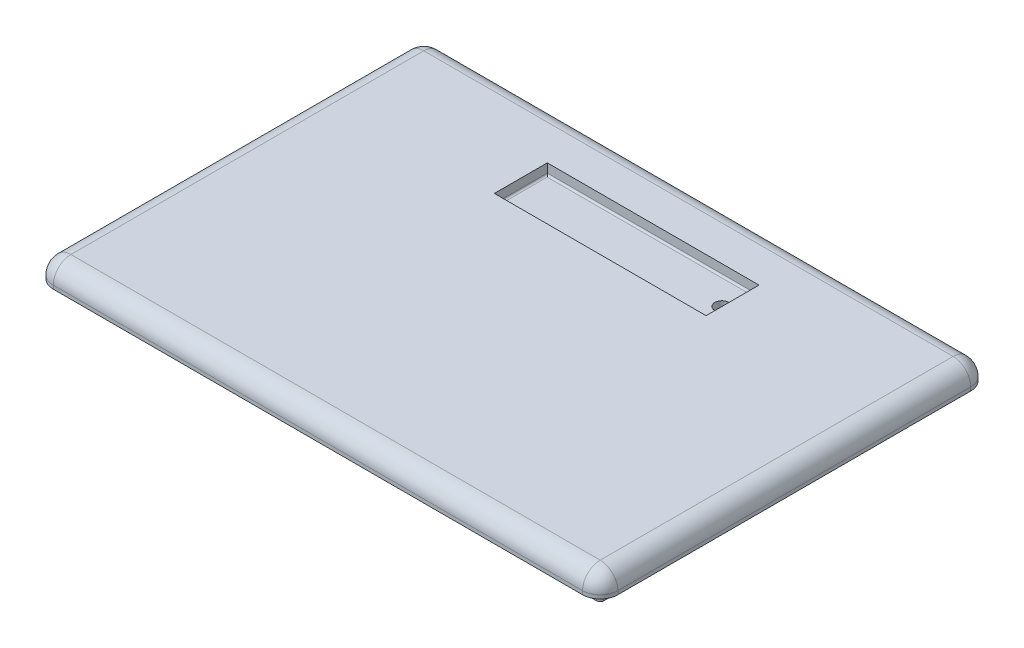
ISO-10303-21;
HEADER;
FILE_DESCRIPTION(('STEP AP214'),'2;1');
FILE_NAME('part.step','',(''),(''),'','','');
FILE_SCHEMA(('AUTOMOTIVE_DESIGN { 1 0 10303 214 1 1 1 1 }'));
ENDSEC;
DATA;
#1=APPLICATION_CONTEXT('core data for automotive mechanical design processes');
#2=APPLICATION_PROTOCOL_DEFINITION('international standard','automotive_design',2000,#1);
#3=PRODUCT_CONTEXT('',#1,'mechanical');
#4=PRODUCT('Part','Part','',(#3));
#5=PRODUCT_RELATED_PRODUCT_CATEGORY('part','',(#4));
#6=PRODUCT_DEFINITION_FORMATION('','',#4);
#7=PRODUCT_DEFINITION_CONTEXT('part definition',#1,'design');
#8=PRODUCT_DEFINITION('design','',#6,#7);
#9=PRODUCT_DEFINITION_SHAPE('','',#8);
#10=(LENGTH_UNIT() NAMED_UNIT(*) SI_UNIT(.MILLI.,.METRE.));
#11=(NAMED_UNIT(*) PLANE_ANGLE_UNIT() SI_UNIT($,.RADIAN.));
#12=(NAMED_UNIT(*) SI_UNIT($,.STERADIAN.) SOLID_ANGLE_UNIT());
#13=UNCERTAINTY_MEASURE_WITH_UNIT(LENGTH_MEASURE(1.E-05),#10,'distance_accuracy_value','');
#14=(GEOMETRIC_REPRESENTATION_CONTEXT(3) GLOBAL_UNCERTAINTY_ASSIGNED_CONTEXT((#13)) GLOBAL_UNIT_ASSIGNED_CONTEXT((#10,
#11,#12)) REPRESENTATION_CONTEXT('',''));
#15=CARTESIAN_POINT('',(0.,0.,0.));
#16=DIRECTION('',(0.,0.,1.));
#17=DIRECTION('',(1.,0.,0.));
#18=AXIS2_PLACEMENT_3D('',#15,#16,#17);
#19=CARTESIAN_POINT('',(-80.,6.,-55.));
#20=DIRECTION('',(1.,0.,0.));
#21=DIRECTION('',(0.,0.,-1.));
#22=AXIS2_PLACEMENT_3D('',#19,#20,#21);
#23=PLANE('',#22);
#24=DIRECTION('',(0.,0.,1.));
#25=VECTOR('',#24,1.);
#26=CARTESIAN_POINT('',(-80.,1.,-55.));
#27=LINE('',#26,#25);
#28=CARTESIAN_POINT('',(-80.,1.,50.));
#29=VERTEX_POINT('',#28);
#30=CARTESIAN_POINT('',(-80.,1.,7.8284271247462));
#31=VERTEX_POINT('',#30);
#32=EDGE_CURVE('E415',#29,#31,#27,.F.);
#33=ORIENTED_EDGE('',*,*,#32,.T.);
#34=CARTESIAN_POINT('',(-80.,0.,5.00000000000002));
#35=DIRECTION('',(-1.,0.,0.));
#36=DIRECTION('',(0.,0.,1.));
#37=AXIS2_PLACEMENT_3D('',#34,#35,#36);
#38=CIRCLE('',#37,2.99999999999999);
#39=CARTESIAN_POINT('',(-80.,0.,8.00000000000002));
#40=VERTEX_POINT('',#39);
#41=EDGE_CURVE('E328',#40,#31,#38,.T.);
#42=ORIENTED_EDGE('',*,*,#41,.F.);
#43=DIRECTION('',(0.,0.,1.));
#44=VECTOR('',#43,1.);
#45=CARTESIAN_POINT('',(-80.,0.,-55.));
#46=LINE('',#45,#44);
#47=CARTESIAN_POINT('',(-80.,0.,50.));
#48=VERTEX_POINT('',#47);
#49=EDGE_CURVE('E389',#40,#48,#46,.T.);
#50=ORIENTED_EDGE('',*,*,#49,.T.);
#51=DIRECTION('',(0.,-1.,0.));
#52=VECTOR('',#51,1.);
#53=CARTESIAN_POINT('',(-80.,6.,50.));
#54=LINE('',#53,#52);
#55=EDGE_CURVE('E418',#48,#29,#54,.F.);
#56=ORIENTED_EDGE('',*,*,#55,.T.);
#57=EDGE_LOOP('',(#33,#42,#50,#56));
#58=FACE_BOUND('',#57,.T.);
#59=ADVANCED_FACE('F63',(#58),#23,.F.);
#60=CARTESIAN_POINT('',(0.,0.,0.));
#61=DIRECTION('',(0.,1.,0.));
#62=DIRECTION('',(0.,0.,1.));
#63=AXIS2_PLACEMENT_3D('',#60,#61,#62);
#64=PLANE('',#63);
#65=ORIENTED_EDGE('',*,*,#49,.F.);
#66=CARTESIAN_POINT('',(-80.,0.,5.00000000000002));
#67=DIRECTION('',(0.,1.,0.));
#68=DIRECTION('',(0.,0.,1.));
#69=AXIS2_PLACEMENT_3D('',#66,#67,#68);
#70=CIRCLE('',#69,2.99999999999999);
#71=CARTESIAN_POINT('',(-77.,0.,5.00000000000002));
#72=VERTEX_POINT('',#71);
#73=EDGE_CURVE('E334',#40,#72,#70,.T.);
#74=ORIENTED_EDGE('',*,*,#73,.T.);
#75=DIRECTION('',(0.,0.,-1.));
#76=VECTOR('',#75,1.);
#77=CARTESIAN_POINT('',(-77.,0.,-5.00000064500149));
#78=LINE('',#77,#76);
#79=CARTESIAN_POINT('',(-77.0000003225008,0.,-5.00000064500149));
#80=VERTEX_POINT('',#79);
#81=EDGE_CURVE('E337',#72,#80,#78,.T.);
#82=ORIENTED_EDGE('',*,*,#81,.T.);
#83=CARTESIAN_POINT('',(-80.,0.,-5.00000064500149));
#84=DIRECTION('',(0.,1.,0.));
#85=DIRECTION('',(0.,0.,-1.));
#86=AXIS2_PLACEMENT_3D('',#83,#84,#85);
#87=CIRCLE('',#86,2.99999967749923);
#88=CARTESIAN_POINT('',(-80.,0.,-7.99999999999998));
#89=VERTEX_POINT('',#88);
#90=EDGE_CURVE('E340',#80,#89,#87,.T.);
#91=ORIENTED_EDGE('',*,*,#90,.T.);
#92=CARTESIAN_POINT('',(-80.,0.,-50.));
#93=VERTEX_POINT('',#92);
#94=EDGE_CURVE('E390',#93,#89,#46,.T.);
#95=ORIENTED_EDGE('',*,*,#94,.F.);
#96=CARTESIAN_POINT('',(-75.,0.,-50.));
#97=DIRECTION('',(0.,1.,0.));
#98=DIRECTION('',(0.,0.,1.));
#99=AXIS2_PLACEMENT_3D('',#96,#97,#98);
#100=CIRCLE('',#99,5.);
#101=CARTESIAN_POINT('',(-75.,0.,-55.));
#102=VERTEX_POINT('',#101);
#103=EDGE_CURVE('E432',#93,#102,#100,.F.);
#104=ORIENTED_EDGE('',*,*,#103,.T.);
#105=DIRECTION('',(-1.,0.,0.));
#106=VECTOR('',#105,1.);
#107=CARTESIAN_POINT('',(-80.,0.,-55.));
#108=LINE('',#107,#106);
#109=CARTESIAN_POINT('',(75.,0.,-55.));
#110=VERTEX_POINT('',#109);
#111=EDGE_CURVE('E385',#110,#102,#108,.T.);
#112=ORIENTED_EDGE('',*,*,#111,.F.);
#113=CARTESIAN_POINT('',(75.,0.,-50.));
#114=DIRECTION('',(0.,1.,0.));
#115=DIRECTION('',(0.,0.,1.));
#116=AXIS2_PLACEMENT_3D('',#113,#114,#115);
#117=CIRCLE('',#116,5.);
#118=CARTESIAN_POINT('',(80.,0.,-50.));
#119=VERTEX_POINT('',#118);
#120=EDGE_CURVE('E434',#110,#119,#117,.F.);
#121=ORIENTED_EDGE('',*,*,#120,.T.);
#122=DIRECTION('',(0.,0.,-1.));
#123=VECTOR('',#122,1.);
#124=CARTESIAN_POINT('',(80.,0.,-55.));
#125=LINE('',#124,#123);
#126=CARTESIAN_POINT('',(80.,0.,50.));
#127=VERTEX_POINT('',#126);
#128=EDGE_CURVE('E382',#127,#119,#125,.T.);
#129=ORIENTED_EDGE('',*,*,#128,.F.);
#130=CARTESIAN_POINT('',(75.,0.,50.));
#131=DIRECTION('',(0.,1.,0.));
#132=DIRECTION('',(0.,0.,1.));
#133=AXIS2_PLACEMENT_3D('',#130,#131,#132);
#134=CIRCLE('',#133,5.);
#135=CARTESIAN_POINT('',(75.,0.,55.));
#136=VERTEX_POINT('',#135);
#137=EDGE_CURVE('E436',#127,#136,#134,.F.);
#138=ORIENTED_EDGE('',*,*,#137,.T.);
#139=DIRECTION('',(1.,0.,0.));
#140=VECTOR('',#139,1.);
#141=CARTESIAN_POINT('',(-80.,0.,55.));
#142=LINE('',#141,#140);
#143=CARTESIAN_POINT('',(-75.,0.,55.));
#144=VERTEX_POINT('',#143);
#145=EDGE_CURVE('E393',#144,#136,#142,.T.);
#146=ORIENTED_EDGE('',*,*,#145,.F.);
#147=CARTESIAN_POINT('',(-75.,0.,50.));
#148=DIRECTION('',(0.,1.,0.));
#149=DIRECTION('',(0.,0.,1.));
#150=AXIS2_PLACEMENT_3D('',#147,#148,#149);
#151=CIRCLE('',#150,5.);
#152=EDGE_CURVE('E438',#144,#48,#151,.F.);
#153=ORIENTED_EDGE('',*,*,#152,.T.);
#154=EDGE_LOOP('',(#65,#74,#82,#91,#95,#104,#112,#121,#129,#138,#146,#153));
#155=FACE_BOUND('',#154,.T.);
#156=DIRECTION('',(0.,0.,1.));
#157=VECTOR('',#156,1.);
#158=CARTESIAN_POINT('',(74.5,0.,49.5));
#159=LINE('',#158,#157);
#160=CARTESIAN_POINT('',(74.5,0.,-48.5));
#161=VERTEX_POINT('',#160);
#162=CARTESIAN_POINT('',(74.5,0.,48.5));
#163=VERTEX_POINT('',#162);
#164=EDGE_CURVE('E358',#161,#163,#159,.T.);
#165=ORIENTED_EDGE('',*,*,#164,.F.);
#166=CARTESIAN_POINT('',(73.5,0.,-48.5));
#167=DIRECTION('',(0.,1.,0.));
#168=DIRECTION('',(0.,0.,1.));
#169=AXIS2_PLACEMENT_3D('',#166,#167,#168);
#170=CIRCLE('',#169,1.);
#171=CARTESIAN_POINT('',(73.5,0.,-49.5));
#172=VERTEX_POINT('',#171);
#173=EDGE_CURVE('E745',#161,#172,#170,.T.);
#174=ORIENTED_EDGE('',*,*,#173,.T.);
#175=DIRECTION('',(1.,0.,0.));
#176=VECTOR('',#175,1.);
#177=CARTESIAN_POINT('',(-74.5,0.,-49.5));
#178=LINE('',#177,#176);
#179=CARTESIAN_POINT('',(-73.5,0.,-49.5));
#180=VERTEX_POINT('',#179);
#181=EDGE_CURVE('E363',#180,#172,#178,.T.);
#182=ORIENTED_EDGE('',*,*,#181,.F.);
#183=CARTESIAN_POINT('',(-73.5,0.,-48.5));
#184=DIRECTION('',(0.,1.,0.));
#185=DIRECTION('',(0.,0.,1.));
#186=AXIS2_PLACEMENT_3D('',#183,#184,#185);
#187=CIRCLE('',#186,1.);
#188=CARTESIAN_POINT('',(-74.5,0.,-48.5));
#189=VERTEX_POINT('',#188);
#190=EDGE_CURVE('E12',#180,#189,#187,.T.);
#191=ORIENTED_EDGE('',*,*,#190,.T.);
#192=DIRECTION('',(0.,0.,-1.));
#193=VECTOR('',#192,1.);
#194=CARTESIAN_POINT('',(-74.5,0.,49.5));
#195=LINE('',#194,#193);
#196=CARTESIAN_POINT('',(-74.5,0.,48.5));
#197=VERTEX_POINT('',#196);
#198=EDGE_CURVE('E378',#197,#189,#195,.T.);
#199=ORIENTED_EDGE('',*,*,#198,.F.);
#200=CARTESIAN_POINT('',(-73.5,0.,48.5));
#201=DIRECTION('',(0.,1.,0.));
#202=DIRECTION('',(0.,0.,1.));
#203=AXIS2_PLACEMENT_3D('',#200,#201,#202);
#204=CIRCLE('',#203,1.);
#205=CARTESIAN_POINT('',(-73.5,0.,49.5));
#206=VERTEX_POINT('',#205);
#207=EDGE_CURVE('E71',#197,#206,#204,.T.);
#208=ORIENTED_EDGE('',*,*,#207,.T.);
#209=DIRECTION('',(-1.,0.,0.));
#210=VECTOR('',#209,1.);
#211=CARTESIAN_POINT('',(-74.5,0.,49.5));
#212=LINE('',#211,#210);
#213=CARTESIAN_POINT('',(73.5,0.,49.5));
#214=VERTEX_POINT('',#213);
#215=EDGE_CURVE('E375',#214,#206,#212,.T.);
#216=ORIENTED_EDGE('',*,*,#215,.F.);
#217=CARTESIAN_POINT('',(73.5,0.,48.5));
#218=DIRECTION('',(0.,1.,0.));
#219=DIRECTION('',(0.,0.,1.));
#220=AXIS2_PLACEMENT_3D('',#217,#218,#219);
#221=CIRCLE('',#220,1.);
#222=EDGE_CURVE('E747',#214,#163,#221,.T.);
#223=ORIENTED_EDGE('',*,*,#222,.T.);
#224=EDGE_LOOP('',(#165,#174,#182,#191,#199,#208,#216,#223));
#225=FACE_BOUND('',#224,.T.);
#226=ADVANCED_FACE('F606',(#155,#225),#64,.F.);
#227=CARTESIAN_POINT('',(80.,6.,-55.));
#228=DIRECTION('',(-1.,0.,0.));
#229=DIRECTION('',(0.,0.,1.));
#230=AXIS2_PLACEMENT_3D('',#227,#228,#229);
#231=PLANE('',#230);
#232=DIRECTION('',(0.,0.,-1.));
#233=VECTOR('',#232,1.);
#234=CARTESIAN_POINT('',(80.,1.,55.));
#235=LINE('',#234,#233);
#236=CARTESIAN_POINT('',(80.,1.,-50.));
#237=VERTEX_POINT('',#236);
#238=CARTESIAN_POINT('',(80.,1.,50.));
#239=VERTEX_POINT('',#238);
#240=EDGE_CURVE('E428',#237,#239,#235,.F.);
#241=ORIENTED_EDGE('',*,*,#240,.T.);
#242=DIRECTION('',(0.,-1.,0.));
#243=VECTOR('',#242,1.);
#244=CARTESIAN_POINT('',(80.,6.,50.));
#245=LINE('',#244,#243);
#246=EDGE_CURVE('E430',#239,#127,#245,.T.);
#247=ORIENTED_EDGE('',*,*,#246,.T.);
#248=ORIENTED_EDGE('',*,*,#128,.T.);
#249=DIRECTION('',(0.,-1.,0.));
#250=VECTOR('',#249,1.);
#251=CARTESIAN_POINT('',(80.,6.,-50.));
#252=LINE('',#251,#250);
#253=EDGE_CURVE('E426',#119,#237,#252,.F.);
#254=ORIENTED_EDGE('',*,*,#253,.T.);
#255=EDGE_LOOP('',(#241,#247,#248,#254));
#256=FACE_BOUND('',#255,.T.);
#257=ADVANCED_FACE('F617',(#256),#231,.F.);
#258=CARTESIAN_POINT('',(-80.,6.,-55.));
#259=DIRECTION('',(0.,0.,1.));
#260=DIRECTION('',(1.,0.,0.));
#261=AXIS2_PLACEMENT_3D('',#258,#259,#260);
#262=PLANE('',#261);
#263=DIRECTION('',(-1.,0.,0.));
#264=VECTOR('',#263,1.);
#265=CARTESIAN_POINT('',(80.,1.,-55.));
#266=LINE('',#265,#264);
#267=CARTESIAN_POINT('',(-75.,1.,-55.));
#268=VERTEX_POINT('',#267);
#269=CARTESIAN_POINT('',(75.,1.,-55.));
#270=VERTEX_POINT('',#269);
#271=EDGE_CURVE('E422',#268,#270,#266,.F.);
#272=ORIENTED_EDGE('',*,*,#271,.T.);
#273=DIRECTION('',(0.,-1.,0.));
#274=VECTOR('',#273,1.);
#275=CARTESIAN_POINT('',(75.,6.,-55.));
#276=LINE('',#275,#274);
#277=EDGE_CURVE('E424',#270,#110,#276,.T.);
#278=ORIENTED_EDGE('',*,*,#277,.T.);
#279=ORIENTED_EDGE('',*,*,#111,.T.);
#280=DIRECTION('',(0.,-1.,0.));
#281=VECTOR('',#280,1.);
#282=CARTESIAN_POINT('',(-75.,6.,-55.));
#283=LINE('',#282,#281);
#284=EDGE_CURVE('E420',#102,#268,#283,.F.);
#285=ORIENTED_EDGE('',*,*,#284,.T.);
#286=EDGE_LOOP('',(#272,#278,#279,#285));
#287=FACE_BOUND('',#286,.T.);
#288=ADVANCED_FACE('F613',(#287),#262,.F.);
#289=ORIENTED_EDGE('',*,*,#94,.T.);
#290=CARTESIAN_POINT('',(-80.,0.,-5.00000064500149));
#291=DIRECTION('',(-1.,0.,0.));
#292=DIRECTION('',(0.,0.,-1.));
#293=AXIS2_PLACEMENT_3D('',#290,#291,#292);
#294=CIRCLE('',#293,2.99999967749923);
#295=CARTESIAN_POINT('',(-80.,1.,-7.82842742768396));
#296=VERTEX_POINT('',#295);
#297=EDGE_CURVE('E332',#296,#89,#294,.T.);
#298=ORIENTED_EDGE('',*,*,#297,.F.);
#299=CARTESIAN_POINT('',(-80.,1.,-50.));
#300=VERTEX_POINT('',#299);
#301=EDGE_CURVE('E414',#296,#300,#27,.F.);
#302=ORIENTED_EDGE('',*,*,#301,.T.);
#303=DIRECTION('',(0.,-1.,0.));
#304=VECTOR('',#303,1.);
#305=CARTESIAN_POINT('',(-80.,6.,-50.));
#306=LINE('',#305,#304);
#307=EDGE_CURVE('E412',#300,#93,#306,.T.);
#308=ORIENTED_EDGE('',*,*,#307,.T.);
#309=EDGE_LOOP('',(#289,#298,#302,#308));
#310=FACE_BOUND('',#309,.T.);
#311=ADVANCED_FACE('F609',(#310),#23,.F.);
#312=CARTESIAN_POINT('',(-80.,6.,55.));
#313=DIRECTION('',(0.,0.,-1.));
#314=DIRECTION('',(-1.,0.,0.));
#315=AXIS2_PLACEMENT_3D('',#312,#313,#314);
#316=PLANE('',#315);
#317=DIRECTION('',(1.,0.,0.));
#318=VECTOR('',#317,1.);
#319=CARTESIAN_POINT('',(-80.,1.,55.));
#320=LINE('',#319,#318);
#321=CARTESIAN_POINT('',(75.,1.,55.));
#322=VERTEX_POINT('',#321);
#323=CARTESIAN_POINT('',(-75.,1.,55.));
#324=VERTEX_POINT('',#323);
#325=EDGE_CURVE('E407',#322,#324,#320,.F.);
#326=ORIENTED_EDGE('',*,*,#325,.T.);
#327=DIRECTION('',(0.,-1.,0.));
#328=VECTOR('',#327,1.);
#329=CARTESIAN_POINT('',(-75.,6.,55.));
#330=LINE('',#329,#328);
#331=EDGE_CURVE('E410',#324,#144,#330,.T.);
#332=ORIENTED_EDGE('',*,*,#331,.T.);
#333=ORIENTED_EDGE('',*,*,#145,.T.);
#334=DIRECTION('',(0.,-1.,0.));
#335=VECTOR('',#334,1.);
#336=CARTESIAN_POINT('',(75.,6.,55.));
#337=LINE('',#336,#335);
#338=EDGE_CURVE('E405',#136,#322,#337,.F.);
#339=ORIENTED_EDGE('',*,*,#338,.T.);
#340=EDGE_LOOP('',(#326,#332,#333,#339));
#341=FACE_BOUND('',#340,.T.);
#342=ADVANCED_FACE('F601',(#341),#316,.F.);
#343=CARTESIAN_POINT('',(0.,6.,0.));
#344=DIRECTION('',(0.,1.,0.));
#345=DIRECTION('',(0.,0.,1.));
#346=AXIS2_PLACEMENT_3D('',#343,#344,#345);
#347=PLANE('',#346);
#348=DIRECTION('',(0.,0.,-1.));
#349=VECTOR('',#348,1.);
#350=CARTESIAN_POINT('',(30.,6.,-40.));
#351=LINE('',#350,#349);
#352=CARTESIAN_POINT('',(30.,6.,-25.));
#353=VERTEX_POINT('',#352);
#354=CARTESIAN_POINT('',(30.,6.,-40.));
#355=VERTEX_POINT('',#354);
#356=EDGE_CURVE('E316',#353,#355,#351,.T.);
#357=ORIENTED_EDGE('',*,*,#356,.F.);
#358=DIRECTION('',(1.,0.,0.));
#359=VECTOR('',#358,1.);
#360=CARTESIAN_POINT('',(-30.,6.,-25.));
#361=LINE('',#360,#359);
#362=CARTESIAN_POINT('',(-30.,6.,-25.));
#363=VERTEX_POINT('',#362);
#364=EDGE_CURVE('E321',#363,#353,#361,.T.);
#365=ORIENTED_EDGE('',*,*,#364,.F.);
#366=DIRECTION('',(0.,0.,1.));
#367=VECTOR('',#366,1.);
#368=CARTESIAN_POINT('',(-30.,6.,-40.));
#369=LINE('',#368,#367);
#370=CARTESIAN_POINT('',(-30.,6.,-40.));
#371=VERTEX_POINT('',#370);
#372=EDGE_CURVE('E300',#371,#363,#369,.T.);
#373=ORIENTED_EDGE('',*,*,#372,.F.);
#374=DIRECTION('',(-1.,0.,0.));
#375=VECTOR('',#374,1.);
#376=CARTESIAN_POINT('',(-30.,6.,-40.));
#377=LINE('',#376,#375);
#378=EDGE_CURVE('E310',#355,#371,#377,.T.);
#379=ORIENTED_EDGE('',*,*,#378,.F.);
#380=EDGE_LOOP('',(#357,#365,#373,#379));
#381=FACE_BOUND('',#380,.T.);
#382=DIRECTION('',(0.,0.,1.));
#383=VECTOR('',#382,1.);
#384=CARTESIAN_POINT('',(-75.,6.,55.));
#385=LINE('',#384,#383);
#386=CARTESIAN_POINT('',(-75.,6.,-50.));
#387=VERTEX_POINT('',#386);
#388=CARTESIAN_POINT('',(-75.,6.,50.));
#389=VERTEX_POINT('',#388);
#390=EDGE_CURVE('E400',#387,#389,#385,.T.);
#391=ORIENTED_EDGE('',*,*,#390,.T.);
#392=DIRECTION('',(1.,0.,0.));
#393=VECTOR('',#392,1.);
#394=CARTESIAN_POINT('',(80.,6.,50.));
#395=LINE('',#394,#393);
#396=CARTESIAN_POINT('',(75.,6.,50.));
#397=VERTEX_POINT('',#396);
#398=EDGE_CURVE('E402',#389,#397,#395,.T.);
#399=ORIENTED_EDGE('',*,*,#398,.T.);
#400=DIRECTION('',(0.,0.,-1.));
#401=VECTOR('',#400,1.);
#402=CARTESIAN_POINT('',(75.,6.,-55.));
#403=LINE('',#402,#401);
#404=CARTESIAN_POINT('',(75.,6.,-50.));
#405=VERTEX_POINT('',#404);
#406=EDGE_CURVE('E396',#397,#405,#403,.T.);
#407=ORIENTED_EDGE('',*,*,#406,.T.);
#408=DIRECTION('',(-1.,0.,0.));
#409=VECTOR('',#408,1.);
#410=CARTESIAN_POINT('',(-80.,6.,-50.));
#411=LINE('',#410,#409);
#412=EDGE_CURVE('E398',#405,#387,#411,.T.);
#413=ORIENTED_EDGE('',*,*,#412,.T.);
#414=EDGE_LOOP('',(#391,#399,#407,#413));
#415=FACE_BOUND('',#414,.T.);
#416=ADVANCED_FACE('F318',(#381,#415),#347,.T.);
#417=CARTESIAN_POINT('',(-75.,6.,-50.));
#418=DIRECTION('',(0.,-1.,0.));
#419=DIRECTION('',(0.,0.,-1.));
#420=AXIS2_PLACEMENT_3D('',#417,#418,#419);
#421=CYLINDRICAL_SURFACE('',#420,5.);
#422=ORIENTED_EDGE('',*,*,#103,.F.);
#423=ORIENTED_EDGE('',*,*,#307,.F.);
#424=CARTESIAN_POINT('',(-75.,1.,-50.));
#425=DIRECTION('',(0.,1.,0.));
#426=DIRECTION('',(0.,0.,1.));
#427=AXIS2_PLACEMENT_3D('',#424,#425,#426);
#428=CIRCLE('',#427,5.);
#429=EDGE_CURVE('E386',#268,#300,#428,.T.);
#430=ORIENTED_EDGE('',*,*,#429,.F.);
#431=ORIENTED_EDGE('',*,*,#284,.F.);
#432=EDGE_LOOP('',(#422,#423,#430,#431));
#433=FACE_BOUND('',#432,.T.);
#434=ADVANCED_FACE('F600',(#433),#421,.T.);
#435=CARTESIAN_POINT('',(0.,1.,-50.));
#436=DIRECTION('',(1.,0.,0.));
#437=DIRECTION('',(0.,0.,-1.));
#438=AXIS2_PLACEMENT_3D('',#435,#436,#437);
#439=CYLINDRICAL_SURFACE('',#438,5.);
#440=CARTESIAN_POINT('',(75.,1.,-50.));
#441=DIRECTION('',(1.,0.,0.));
#442=DIRECTION('',(0.,0.,-1.));
#443=AXIS2_PLACEMENT_3D('',#440,#441,#442);
#444=CIRCLE('',#443,5.);
#445=EDGE_CURVE('E466',#270,#405,#444,.T.);
#446=ORIENTED_EDGE('',*,*,#445,.F.);
#447=ORIENTED_EDGE('',*,*,#271,.F.);
#448=CARTESIAN_POINT('',(-75.,1.,-50.));
#449=DIRECTION('',(-1.,0.,0.));
#450=DIRECTION('',(0.,0.,1.));
#451=AXIS2_PLACEMENT_3D('',#448,#449,#450);
#452=CIRCLE('',#451,5.);
#453=EDGE_CURVE('E469',#387,#268,#452,.T.);
#454=ORIENTED_EDGE('',*,*,#453,.F.);
#455=ORIENTED_EDGE('',*,*,#412,.F.);
#456=EDGE_LOOP('',(#446,#447,#454,#455));
#457=FACE_BOUND('',#456,.T.);
#458=ADVANCED_FACE('F830',(#457),#439,.T.);
#459=CARTESIAN_POINT('',(75.,6.,-50.));
#460=DIRECTION('',(0.,-1.,0.));
#461=DIRECTION('',(0.,0.,-1.));
#462=AXIS2_PLACEMENT_3D('',#459,#460,#461);
#463=CYLINDRICAL_SURFACE('',#462,5.);
#464=ORIENTED_EDGE('',*,*,#120,.F.);
#465=ORIENTED_EDGE('',*,*,#277,.F.);
#466=CARTESIAN_POINT('',(75.,1.,-50.));
#467=DIRECTION('',(0.,1.,0.));
#468=DIRECTION('',(0.,0.,1.));
#469=AXIS2_PLACEMENT_3D('',#466,#467,#468);
#470=CIRCLE('',#469,5.);
#471=EDGE_CURVE('E463',#237,#270,#470,.T.);
#472=ORIENTED_EDGE('',*,*,#471,.F.);
#473=ORIENTED_EDGE('',*,*,#253,.F.);
#474=EDGE_LOOP('',(#464,#465,#472,#473));
#475=FACE_BOUND('',#474,.T.);
#476=ADVANCED_FACE('F833',(#475),#463,.T.);
#477=CARTESIAN_POINT('',(-75.,1.,-50.));
#478=DIRECTION('',(0.,0.,1.));
#479=DIRECTION('',(1.,0.,0.));
#480=AXIS2_PLACEMENT_3D('',#477,#478,#479);
#481=SPHERICAL_SURFACE('',#480,5.);
#482=ORIENTED_EDGE('',*,*,#453,.T.);
#483=ORIENTED_EDGE('',*,*,#429,.T.);
#484=CARTESIAN_POINT('',(-75.,1.,-50.));
#485=DIRECTION('',(0.,0.,-1.));
#486=DIRECTION('',(-1.,0.,0.));
#487=AXIS2_PLACEMENT_3D('',#484,#485,#486);
#488=CIRCLE('',#487,5.);
#489=EDGE_CURVE('E460',#387,#300,#488,.F.);
#490=ORIENTED_EDGE('',*,*,#489,.F.);
#491=EDGE_LOOP('',(#482,#483,#490));
#492=FACE_BOUND('',#491,.T.);
#493=ADVANCED_FACE('F674',(#492),#481,.T.);
#494=CARTESIAN_POINT('',(75.,1.,-50.));
#495=DIRECTION('',(0.,0.,1.));
#496=DIRECTION('',(1.,0.,0.));
#497=AXIS2_PLACEMENT_3D('',#494,#495,#496);
#498=SPHERICAL_SURFACE('',#497,5.);
#499=ORIENTED_EDGE('',*,*,#471,.T.);
#500=ORIENTED_EDGE('',*,*,#445,.T.);
#501=CARTESIAN_POINT('',(75.,1.,-50.));
#502=DIRECTION('',(0.,0.,-1.));
#503=DIRECTION('',(-1.,0.,0.));
#504=AXIS2_PLACEMENT_3D('',#501,#502,#503);
#505=CIRCLE('',#504,5.);
#506=EDGE_CURVE('E457',#237,#405,#505,.F.);
#507=ORIENTED_EDGE('',*,*,#506,.F.);
#508=EDGE_LOOP('',(#499,#500,#507));
#509=FACE_BOUND('',#508,.T.);
#510=ADVANCED_FACE('F840',(#509),#498,.T.);
#511=CARTESIAN_POINT('',(-75.,6.,50.));
#512=DIRECTION('',(0.,-1.,0.));
#513=DIRECTION('',(0.,0.,-1.));
#514=AXIS2_PLACEMENT_3D('',#511,#512,#513);
#515=CYLINDRICAL_SURFACE('',#514,5.);
#516=ORIENTED_EDGE('',*,*,#152,.F.);
#517=ORIENTED_EDGE('',*,*,#331,.F.);
#518=CARTESIAN_POINT('',(-75.,1.,50.));
#519=DIRECTION('',(0.,1.,0.));
#520=DIRECTION('',(0.,0.,1.));
#521=AXIS2_PLACEMENT_3D('',#518,#519,#520);
#522=CIRCLE('',#521,5.);
#523=EDGE_CURVE('E454',#29,#324,#522,.T.);
#524=ORIENTED_EDGE('',*,*,#523,.F.);
#525=ORIENTED_EDGE('',*,*,#55,.F.);
#526=EDGE_LOOP('',(#516,#517,#524,#525));
#527=FACE_BOUND('',#526,.T.);
#528=ADVANCED_FACE('F642',(#527),#515,.T.);
#529=CARTESIAN_POINT('',(-75.,1.,0.));
#530=DIRECTION('',(0.,0.,-1.));
#531=DIRECTION('',(-1.,0.,0.));
#532=AXIS2_PLACEMENT_3D('',#529,#530,#531);
#533=CYLINDRICAL_SURFACE('',#532,5.);
#534=CARTESIAN_POINT('',(-79.999999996,0.9998,7.82849782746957));
#535=CARTESIAN_POINT('',(-80.0000149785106,1.07511260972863,7.80188489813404));
#536=CARTESIAN_POINT('',(-79.9983047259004,1.14933984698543,7.77225638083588));
#537=CARTESIAN_POINT('',(-79.9918164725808,1.29504565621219,7.7072401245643));
#538=CARTESIAN_POINT('',(-79.9870400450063,1.36652561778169,7.67185534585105));
#539=CARTESIAN_POINT('',(-79.974822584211,1.50599541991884,7.59570276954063));
#540=CARTESIAN_POINT('',(-79.9673908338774,1.57399648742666,7.55495403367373));
#541=CARTESIAN_POINT('',(-79.9503121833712,1.70630303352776,7.46827821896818));
#542=CARTESIAN_POINT('',(-79.9406650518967,1.77060812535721,7.42235059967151));
#543=CARTESIAN_POINT('',(-79.9091443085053,1.95715662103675,7.27737681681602));
#544=CARTESIAN_POINT('',(-79.8846584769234,2.07336262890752,7.17095942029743));
#545=CARTESIAN_POINT('',(-79.8328356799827,2.28678723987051,6.94113051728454));
#546=CARTESIAN_POINT('',(-79.8054964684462,2.38399070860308,6.81770559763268));
#547=CARTESIAN_POINT('',(-79.7508838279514,2.56144879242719,6.5506591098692));
#548=CARTESIAN_POINT('',(-79.7236708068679,2.64072277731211,6.40637127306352));
#549=CARTESIAN_POINT('',(-79.675000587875,2.77467997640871,6.10596169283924));
#550=CARTESIAN_POINT('',(-79.65354045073,2.82937575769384,5.94984604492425));
#551=CARTESIAN_POINT('',(-79.6230812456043,2.90484112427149,5.66153618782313));
#552=CARTESIAN_POINT('',(-79.6124590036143,2.93017515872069,5.53069934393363));
#553=CARTESIAN_POINT('',(-79.6017326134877,2.95553896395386,5.33260694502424));
#554=CARTESIAN_POINT('',(-79.5990249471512,2.96188736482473,5.26624877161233));
#555=CARTESIAN_POINT('',(-79.5954013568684,2.97035435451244,5.13319986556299));
#556=CARTESIAN_POINT('',(-79.5944858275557,2.97247201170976,5.06650906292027));
#557=CARTESIAN_POINT('',(-79.5944935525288,2.97246774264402,4.99980000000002));
#558=B_SPLINE_CURVE_WITH_KNOTS('',3,(#534,#535,#536,#537,#538,#539,#540,#541,#542,#543,#544,
#545,#546,#547,#548,#549,#550,#551,#552,#553,#554,#555,#556,#557),.UNSPECIFIED.,.F.,.F.,(4,2,2,
2,2,2,2,2,2,2,2,4),(0.,0.239518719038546,0.478914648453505,0.717481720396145,0.956073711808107,
1.43214092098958,1.90858575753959,2.40686051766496,2.90488021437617,3.30464186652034,
3.50464869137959,3.70469955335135),.UNSPECIFIED.);
#559=CARTESIAN_POINT('',(-79.5944936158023,2.97246759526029,5.00000000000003));
#560=VERTEX_POINT('',#559);
#561=EDGE_CURVE('E541',#31,#560,#558,.T.);
#562=ORIENTED_EDGE('',*,*,#561,.F.);
#563=ORIENTED_EDGE('',*,*,#32,.F.);
#564=CARTESIAN_POINT('',(-75.,1.,50.));
#565=DIRECTION('',(0.,0.,1.));
#566=DIRECTION('',(1.,0.,0.));
#567=AXIS2_PLACEMENT_3D('',#564,#565,#566);
#568=CIRCLE('',#567,5.);
#569=EDGE_CURVE('E451',#389,#29,#568,.T.);
#570=ORIENTED_EDGE('',*,*,#569,.F.);
#571=ORIENTED_EDGE('',*,*,#390,.F.);
#572=ORIENTED_EDGE('',*,*,#489,.T.);
#573=ORIENTED_EDGE('',*,*,#301,.F.);
#574=CARTESIAN_POINT('',(-79.5944936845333,2.97246743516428,-4.99980064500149));
#575=CARTESIAN_POINT('',(-79.5944718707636,2.97247815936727,-5.08266341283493));
#576=CARTESIAN_POINT('',(-79.5958939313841,2.96920483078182,-5.16552015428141));
#577=CARTESIAN_POINT('',(-79.6014813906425,2.95613428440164,-5.33060839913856));
#578=CARTESIAN_POINT('',(-79.6056462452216,2.94633836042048,-5.41284002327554));
#579=CARTESIAN_POINT('',(-79.616563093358,2.92029518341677,-5.57592050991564));
#580=CARTESIAN_POINT('',(-79.6233094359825,2.90406201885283,-5.6567719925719));
#581=CARTESIAN_POINT('',(-79.639105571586,2.86524404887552,-5.81668379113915));
#582=CARTESIAN_POINT('',(-79.6481554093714,2.84265911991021,-5.89574407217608));
#583=CARTESIAN_POINT('',(-79.6782443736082,2.76553555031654,-6.12938967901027));
#584=CARTESIAN_POINT('',(-79.7022361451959,2.70159960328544,-6.28061832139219));
#585=CARTESIAN_POINT('',(-79.7543528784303,2.55000369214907,-6.56988461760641));
#586=CARTESIAN_POINT('',(-79.7824800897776,2.46233079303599,-6.70791502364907));
#587=CARTESIAN_POINT('',(-79.8389231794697,2.26321542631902,-6.96984083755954));
#588=CARTESIAN_POINT('',(-79.867232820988,2.15136081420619,-7.09342524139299));
#589=CARTESIAN_POINT('',(-79.918506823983,1.90759517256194,-7.32007365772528));
#590=CARTESIAN_POINT('',(-79.9414774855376,1.77570808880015,-7.42316183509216));
#591=CARTESIAN_POINT('',(-79.9721041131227,1.53677603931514,-7.57907995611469));
#592=CARTESIAN_POINT('',(-79.9822777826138,1.43384707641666,-7.63777139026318));
#593=CARTESIAN_POINT('',(-79.9927426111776,1.27452093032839,-7.71644484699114));
#594=CARTESIAN_POINT('',(-79.9954317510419,1.22056194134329,-7.74111868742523));
#595=CARTESIAN_POINT('',(-79.9990633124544,1.11120368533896,-7.78724863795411));
#596=CARTESIAN_POINT('',(-80.0000050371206,1.05580385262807,-7.8087034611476));
#597=CARTESIAN_POINT('',(-79.999999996,0.999800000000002,-7.82849813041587));
#598=B_SPLINE_CURVE_WITH_KNOTS('',3,(#574,#575,#576,#577,#578,#579,#580,#581,#582,#583,#584,
#585,#586,#587,#588,#589,#590,#591,#592,#593,#594,#595,#596,#597),.UNSPECIFIED.,.F.,.F.,(4,2,2,
2,2,2,2,2,2,2,2,4),(0.,0.248500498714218,0.496951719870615,0.744862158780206,0.992777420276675,
1.48807089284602,1.98363481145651,2.48842496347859,2.99261639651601,3.34838638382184,
3.52644916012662,3.70458293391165),.UNSPECIFIED.);
#599=CARTESIAN_POINT('',(-79.5944936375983,2.97246743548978,-5.00000064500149));
#600=VERTEX_POINT('',#599);
#601=EDGE_CURVE('E533',#600,#296,#598,.T.);
#602=ORIENTED_EDGE('',*,*,#601,.F.);
#603=DIRECTION('',(0.,0.,1.));
#604=VECTOR('',#603,1.);
#605=CARTESIAN_POINT('',(-79.5944936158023,2.9724675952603,-3.22500730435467E-07));
#606=LINE('',#605,#604);
#607=EDGE_CURVE('E523',#560,#600,#606,.F.);
#608=ORIENTED_EDGE('',*,*,#607,.F.);
#609=EDGE_LOOP('',(#562,#563,#570,#571,#572,#573,#602,#608));
#610=FACE_BOUND('',#609,.T.);
#611=ADVANCED_FACE('F548',(#610),#533,.T.);
#612=CARTESIAN_POINT('',(75.,1.,0.));
#613=DIRECTION('',(0.,0.,1.));
#614=DIRECTION('',(1.,0.,0.));
#615=AXIS2_PLACEMENT_3D('',#612,#613,#614);
#616=CYLINDRICAL_SURFACE('',#615,5.);
#617=ORIENTED_EDGE('',*,*,#506,.T.);
#618=ORIENTED_EDGE('',*,*,#406,.F.);
#619=CARTESIAN_POINT('',(75.,1.,50.));
#620=DIRECTION('',(0.,0.,1.));
#621=DIRECTION('',(0.,-1.,0.));
#622=AXIS2_PLACEMENT_3D('',#619,#620,#621);
#623=CIRCLE('',#622,5.);
#624=EDGE_CURVE('E448',#239,#397,#623,.T.);
#625=ORIENTED_EDGE('',*,*,#624,.F.);
#626=ORIENTED_EDGE('',*,*,#240,.F.);
#627=EDGE_LOOP('',(#617,#618,#625,#626));
#628=FACE_BOUND('',#627,.T.);
#629=ADVANCED_FACE('F635',(#628),#616,.T.);
#630=CARTESIAN_POINT('',(75.,6.,50.));
#631=DIRECTION('',(0.,-1.,0.));
#632=DIRECTION('',(0.,0.,-1.));
#633=AXIS2_PLACEMENT_3D('',#630,#631,#632);
#634=CYLINDRICAL_SURFACE('',#633,5.);
#635=ORIENTED_EDGE('',*,*,#137,.F.);
#636=ORIENTED_EDGE('',*,*,#246,.F.);
#637=CARTESIAN_POINT('',(75.,1.,50.));
#638=DIRECTION('',(0.,1.,0.));
#639=DIRECTION('',(0.,0.,1.));
#640=AXIS2_PLACEMENT_3D('',#637,#638,#639);
#641=CIRCLE('',#640,5.);
#642=EDGE_CURVE('E445',#322,#239,#641,.T.);
#643=ORIENTED_EDGE('',*,*,#642,.F.);
#644=ORIENTED_EDGE('',*,*,#338,.F.);
#645=EDGE_LOOP('',(#635,#636,#643,#644));
#646=FACE_BOUND('',#645,.T.);
#647=ADVANCED_FACE('F632',(#646),#634,.T.);
#648=CARTESIAN_POINT('',(-75.,1.,50.));
#649=DIRECTION('',(0.,0.,1.));
#650=DIRECTION('',(1.,0.,0.));
#651=AXIS2_PLACEMENT_3D('',#648,#649,#650);
#652=SPHERICAL_SURFACE('',#651,5.);
#653=ORIENTED_EDGE('',*,*,#569,.T.);
#654=ORIENTED_EDGE('',*,*,#523,.T.);
#655=CARTESIAN_POINT('',(-75.,1.,50.));
#656=DIRECTION('',(-1.,0.,0.));
#657=DIRECTION('',(0.,0.,1.));
#658=AXIS2_PLACEMENT_3D('',#655,#656,#657);
#659=CIRCLE('',#658,5.);
#660=EDGE_CURVE('E443',#389,#324,#659,.F.);
#661=ORIENTED_EDGE('',*,*,#660,.F.);
#662=EDGE_LOOP('',(#653,#654,#661));
#663=FACE_BOUND('',#662,.T.);
#664=ADVANCED_FACE('F628',(#663),#652,.T.);
#665=CARTESIAN_POINT('',(75.,1.,50.));
#666=DIRECTION('',(0.,0.,1.));
#667=DIRECTION('',(1.,0.,0.));
#668=AXIS2_PLACEMENT_3D('',#665,#666,#667);
#669=SPHERICAL_SURFACE('',#668,5.);
#670=ORIENTED_EDGE('',*,*,#642,.T.);
#671=ORIENTED_EDGE('',*,*,#624,.T.);
#672=CARTESIAN_POINT('',(75.,1.,50.));
#673=DIRECTION('',(1.,0.,0.));
#674=DIRECTION('',(0.,0.,-1.));
#675=AXIS2_PLACEMENT_3D('',#672,#673,#674);
#676=CIRCLE('',#675,5.);
#677=EDGE_CURVE('E372',#322,#397,#676,.F.);
#678=ORIENTED_EDGE('',*,*,#677,.F.);
#679=EDGE_LOOP('',(#670,#671,#678));
#680=FACE_BOUND('',#679,.T.);
#681=ADVANCED_FACE('F624',(#680),#669,.T.);
#682=CARTESIAN_POINT('',(0.,1.,50.));
#683=DIRECTION('',(-1.,0.,0.));
#684=DIRECTION('',(0.,0.,1.));
#685=AXIS2_PLACEMENT_3D('',#682,#683,#684);
#686=CYLINDRICAL_SURFACE('',#685,5.);
#687=ORIENTED_EDGE('',*,*,#660,.T.);
#688=ORIENTED_EDGE('',*,*,#325,.F.);
#689=ORIENTED_EDGE('',*,*,#677,.T.);
#690=ORIENTED_EDGE('',*,*,#398,.F.);
#691=EDGE_LOOP('',(#687,#688,#689,#690));
#692=FACE_BOUND('',#691,.T.);
#693=ADVANCED_FACE('F582',(#692),#686,.T.);
#694=CARTESIAN_POINT('',(0.,-5.,0.));
#695=DIRECTION('',(0.,-1.,0.));
#696=DIRECTION('',(0.,0.,-1.));
#697=AXIS2_PLACEMENT_3D('',#694,#695,#696);
#698=PLANE('',#697);
#699=DIRECTION('',(0.,0.,1.));
#700=VECTOR('',#699,1.);
#701=CARTESIAN_POINT('',(70.5,-5.,0.));
#702=LINE('',#701,#700);
#703=CARTESIAN_POINT('',(70.5,-5.,45.5));
#704=VERTEX_POINT('',#703);
#705=CARTESIAN_POINT('',(70.5,-5.,-45.5));
#706=VERTEX_POINT('',#705);
#707=EDGE_CURVE('E512',#704,#706,#702,.F.);
#708=ORIENTED_EDGE('',*,*,#707,.T.);
#709=DIRECTION('',(1.,0.,0.));
#710=VECTOR('',#709,1.);
#711=CARTESIAN_POINT('',(0.,-5.,-45.5));
#712=LINE('',#711,#710);
#713=CARTESIAN_POINT('',(-70.5,-5.,-45.5));
#714=VERTEX_POINT('',#713);
#715=EDGE_CURVE('E514',#706,#714,#712,.F.);
#716=ORIENTED_EDGE('',*,*,#715,.T.);
#717=DIRECTION('',(0.,0.,-1.));
#718=VECTOR('',#717,1.);
#719=CARTESIAN_POINT('',(-70.5,-5.,0.));
#720=LINE('',#719,#718);
#721=CARTESIAN_POINT('',(-70.5,-5.,45.5));
#722=VERTEX_POINT('',#721);
#723=EDGE_CURVE('E508',#714,#722,#720,.F.);
#724=ORIENTED_EDGE('',*,*,#723,.T.);
#725=DIRECTION('',(-1.,0.,0.));
#726=VECTOR('',#725,1.);
#727=CARTESIAN_POINT('',(0.,-5.,45.5));
#728=LINE('',#727,#726);
#729=EDGE_CURVE('E510',#722,#704,#728,.F.);
#730=ORIENTED_EDGE('',*,*,#729,.T.);
#731=EDGE_LOOP('',(#708,#716,#724,#730));
#732=FACE_BOUND('',#731,.T.);
#733=DIRECTION('',(1.,0.,0.));
#734=VECTOR('',#733,1.);
#735=CARTESIAN_POINT('',(-74.5,-5.,-49.5));
#736=LINE('',#735,#734);
#737=CARTESIAN_POINT('',(-73.5,-5.,-49.5));
#738=VERTEX_POINT('',#737);
#739=CARTESIAN_POINT('',(73.5,-5.,-49.5));
#740=VERTEX_POINT('',#739);
#741=EDGE_CURVE('E369',#738,#740,#736,.T.);
#742=ORIENTED_EDGE('',*,*,#741,.T.);
#743=CARTESIAN_POINT('',(73.5,-5.,-48.5));
#744=DIRECTION('',(0.,-1.,0.));
#745=DIRECTION('',(0.,0.,-1.));
#746=AXIS2_PLACEMENT_3D('',#743,#744,#745);
#747=CIRCLE('',#746,1.);
#748=CARTESIAN_POINT('',(74.5,-5.,-48.5));
#749=VERTEX_POINT('',#748);
#750=EDGE_CURVE('E734',#740,#749,#747,.T.);
#751=ORIENTED_EDGE('',*,*,#750,.T.);
#752=DIRECTION('',(0.,0.,1.));
#753=VECTOR('',#752,1.);
#754=CARTESIAN_POINT('',(74.5,-5.,49.5));
#755=LINE('',#754,#753);
#756=CARTESIAN_POINT('',(74.5,-5.,48.5));
#757=VERTEX_POINT('',#756);
#758=EDGE_CURVE('E359',#749,#757,#755,.T.);
#759=ORIENTED_EDGE('',*,*,#758,.T.);
#760=CARTESIAN_POINT('',(73.5,-5.,48.5));
#761=DIRECTION('',(0.,-1.,0.));
#762=DIRECTION('',(0.,0.,-1.));
#763=AXIS2_PLACEMENT_3D('',#760,#761,#762);
#764=CIRCLE('',#763,1.);
#765=CARTESIAN_POINT('',(73.5,-5.,49.5));
#766=VERTEX_POINT('',#765);
#767=EDGE_CURVE('E732',#757,#766,#764,.T.);
#768=ORIENTED_EDGE('',*,*,#767,.T.);
#769=DIRECTION('',(-1.,0.,0.));
#770=VECTOR('',#769,1.);
#771=CARTESIAN_POINT('',(-74.5,-5.,49.5));
#772=LINE('',#771,#770);
#773=CARTESIAN_POINT('',(-73.5,-5.,49.5));
#774=VERTEX_POINT('',#773);
#775=EDGE_CURVE('E362',#766,#774,#772,.T.);
#776=ORIENTED_EDGE('',*,*,#775,.T.);
#777=CARTESIAN_POINT('',(-73.5,-5.,48.5));
#778=DIRECTION('',(0.,-1.,0.));
#779=DIRECTION('',(0.,0.,-1.));
#780=AXIS2_PLACEMENT_3D('',#777,#778,#779);
#781=CIRCLE('',#780,1.);
#782=CARTESIAN_POINT('',(-74.5,-5.,48.5));
#783=VERTEX_POINT('',#782);
#784=EDGE_CURVE('E730',#774,#783,#781,.T.);
#785=ORIENTED_EDGE('',*,*,#784,.T.);
#786=DIRECTION('',(0.,0.,-1.));
#787=VECTOR('',#786,1.);
#788=CARTESIAN_POINT('',(-74.5,-5.,49.5));
#789=LINE('',#788,#787);
#790=CARTESIAN_POINT('',(-74.5,-5.,-48.5));
#791=VERTEX_POINT('',#790);
#792=EDGE_CURVE('E366',#783,#791,#789,.T.);
#793=ORIENTED_EDGE('',*,*,#792,.T.);
#794=CARTESIAN_POINT('',(-73.5,-5.,-48.5));
#795=DIRECTION('',(0.,-1.,0.));
#796=DIRECTION('',(0.,0.,-1.));
#797=AXIS2_PLACEMENT_3D('',#794,#795,#796);
#798=CIRCLE('',#797,1.);
#799=EDGE_CURVE('E728',#791,#738,#798,.T.);
#800=ORIENTED_EDGE('',*,*,#799,.T.);
#801=EDGE_LOOP('',(#742,#751,#759,#768,#776,#785,#793,#800));
#802=FACE_BOUND('',#801,.T.);
#803=ADVANCED_FACE('F578',(#732,#802),#698,.T.);
#804=CARTESIAN_POINT('',(74.5,-5.,49.5));
#805=DIRECTION('',(-1.,0.,0.));
#806=DIRECTION('',(0.,0.,1.));
#807=AXIS2_PLACEMENT_3D('',#804,#805,#806);
#808=PLANE('',#807);
#809=ORIENTED_EDGE('',*,*,#758,.F.);
#810=DIRECTION('',(0.,1.,0.));
#811=VECTOR('',#810,1.);
#812=CARTESIAN_POINT('',(74.5,-5.,-48.5));
#813=LINE('',#812,#811);
#814=EDGE_CURVE('E720',#749,#161,#813,.T.);
#815=ORIENTED_EDGE('',*,*,#814,.T.);
#816=ORIENTED_EDGE('',*,*,#164,.T.);
#817=DIRECTION('',(0.,1.,0.));
#818=VECTOR('',#817,1.);
#819=CARTESIAN_POINT('',(74.5,-5.,48.5));
#820=LINE('',#819,#818);
#821=EDGE_CURVE('E707',#163,#757,#820,.F.);
#822=ORIENTED_EDGE('',*,*,#821,.T.);
#823=EDGE_LOOP('',(#809,#815,#816,#822));
#824=FACE_BOUND('',#823,.T.);
#825=ADVANCED_FACE('F581',(#824),#808,.F.);
#826=CARTESIAN_POINT('',(-74.5,-5.,49.5));
#827=DIRECTION('',(0.,0.,-1.));
#828=DIRECTION('',(-1.,0.,0.));
#829=AXIS2_PLACEMENT_3D('',#826,#827,#828);
#830=PLANE('',#829);
#831=ORIENTED_EDGE('',*,*,#775,.F.);
#832=DIRECTION('',(0.,1.,0.));
#833=VECTOR('',#832,1.);
#834=CARTESIAN_POINT('',(73.5,-5.,49.5));
#835=LINE('',#834,#833);
#836=EDGE_CURVE('E738',#766,#214,#835,.T.);
#837=ORIENTED_EDGE('',*,*,#836,.T.);
#838=ORIENTED_EDGE('',*,*,#215,.T.);
#839=DIRECTION('',(0.,1.,0.));
#840=VECTOR('',#839,1.);
#841=CARTESIAN_POINT('',(-73.5,-5.,49.5));
#842=LINE('',#841,#840);
#843=EDGE_CURVE('E736',#206,#774,#842,.F.);
#844=ORIENTED_EDGE('',*,*,#843,.T.);
#845=EDGE_LOOP('',(#831,#837,#838,#844));
#846=FACE_BOUND('',#845,.T.);
#847=ADVANCED_FACE('F590',(#846),#830,.F.);
#848=CARTESIAN_POINT('',(-74.5,-5.,49.5));
#849=DIRECTION('',(1.,0.,0.));
#850=DIRECTION('',(0.,0.,-1.));
#851=AXIS2_PLACEMENT_3D('',#848,#849,#850);
#852=PLANE('',#851);
#853=ORIENTED_EDGE('',*,*,#792,.F.);
#854=DIRECTION('',(0.,1.,0.));
#855=VECTOR('',#854,1.);
#856=CARTESIAN_POINT('',(-74.5,-5.,48.5));
#857=LINE('',#856,#855);
#858=EDGE_CURVE('E743',#783,#197,#857,.T.);
#859=ORIENTED_EDGE('',*,*,#858,.T.);
#860=ORIENTED_EDGE('',*,*,#198,.T.);
#861=DIRECTION('',(0.,1.,0.));
#862=VECTOR('',#861,1.);
#863=CARTESIAN_POINT('',(-74.5,-5.,-48.5));
#864=LINE('',#863,#862);
#865=EDGE_CURVE('E741',#189,#791,#864,.F.);
#866=ORIENTED_EDGE('',*,*,#865,.T.);
#867=EDGE_LOOP('',(#853,#859,#860,#866));
#868=FACE_BOUND('',#867,.T.);
#869=ADVANCED_FACE('F586',(#868),#852,.F.);
#870=CARTESIAN_POINT('',(-74.5,-5.,-49.5));
#871=DIRECTION('',(0.,0.,1.));
#872=DIRECTION('',(1.,0.,0.));
#873=AXIS2_PLACEMENT_3D('',#870,#871,#872);
#874=PLANE('',#873);
#875=ORIENTED_EDGE('',*,*,#181,.T.);
#876=DIRECTION('',(0.,1.,0.));
#877=VECTOR('',#876,1.);
#878=CARTESIAN_POINT('',(73.5,-5.,-49.5));
#879=LINE('',#878,#877);
#880=EDGE_CURVE('E726',#172,#740,#879,.F.);
#881=ORIENTED_EDGE('',*,*,#880,.T.);
#882=ORIENTED_EDGE('',*,*,#741,.F.);
#883=DIRECTION('',(0.,1.,0.));
#884=VECTOR('',#883,1.);
#885=CARTESIAN_POINT('',(-73.5,-5.,-49.5));
#886=LINE('',#885,#884);
#887=EDGE_CURVE('E723',#738,#180,#886,.T.);
#888=ORIENTED_EDGE('',*,*,#887,.T.);
#889=EDGE_LOOP('',(#875,#881,#882,#888));
#890=FACE_BOUND('',#889,.T.);
#891=ADVANCED_FACE('F576',(#890),#874,.F.);
#892=CARTESIAN_POINT('',(69.5,-5.,49.5));
#893=DIRECTION('',(-1.,0.,0.));
#894=DIRECTION('',(0.,0.,1.));
#895=AXIS2_PLACEMENT_3D('',#892,#893,#894);
#896=PLANE('',#895);
#897=DIRECTION('',(0.,1.,0.));
#898=VECTOR('',#897,1.);
#899=CARTESIAN_POINT('',(69.5,-5.,-44.5));
#900=LINE('',#899,#898);
#901=CARTESIAN_POINT('',(69.5,-4.,-44.5));
#902=VERTEX_POINT('',#901);
#903=CARTESIAN_POINT('',(69.5,-3.,-44.5));
#904=VERTEX_POINT('',#903);
#905=EDGE_CURVE('E349',#902,#904,#900,.T.);
#906=ORIENTED_EDGE('',*,*,#905,.F.);
#907=DIRECTION('',(0.,0.,1.));
#908=VECTOR('',#907,1.);
#909=CARTESIAN_POINT('',(69.5,-4.,49.5));
#910=LINE('',#909,#908);
#911=CARTESIAN_POINT('',(69.5,-4.,44.5));
#912=VERTEX_POINT('',#911);
#913=EDGE_CURVE('E517',#902,#912,#910,.T.);
#914=ORIENTED_EDGE('',*,*,#913,.T.);
#915=DIRECTION('',(0.,1.,0.));
#916=VECTOR('',#915,1.);
#917=CARTESIAN_POINT('',(69.5,-5.,44.5));
#918=LINE('',#917,#916);
#919=CARTESIAN_POINT('',(69.5,-3.,44.5));
#920=VERTEX_POINT('',#919);
#921=EDGE_CURVE('E356',#912,#920,#918,.T.);
#922=ORIENTED_EDGE('',*,*,#921,.T.);
#923=DIRECTION('',(0.,0.,1.));
#924=VECTOR('',#923,1.);
#925=CARTESIAN_POINT('',(69.5,-3.,49.5));
#926=LINE('',#925,#924);
#927=EDGE_CURVE('E488',#920,#904,#926,.F.);
#928=ORIENTED_EDGE('',*,*,#927,.T.);
#929=EDGE_LOOP('',(#906,#914,#922,#928));
#930=FACE_BOUND('',#929,.T.);
#931=ADVANCED_FACE('F572',(#930),#896,.T.);
#932=CARTESIAN_POINT('',(-74.5,-5.,44.5));
#933=DIRECTION('',(0.,0.,-1.));
#934=DIRECTION('',(-1.,0.,0.));
#935=AXIS2_PLACEMENT_3D('',#932,#933,#934);
#936=PLANE('',#935);
#937=ORIENTED_EDGE('',*,*,#921,.F.);
#938=DIRECTION('',(-1.,0.,0.));
#939=VECTOR('',#938,1.);
#940=CARTESIAN_POINT('',(-74.5,-4.,44.5));
#941=LINE('',#940,#939);
#942=CARTESIAN_POINT('',(-69.5,-4.,44.5));
#943=VERTEX_POINT('',#942);
#944=EDGE_CURVE('E519',#912,#943,#941,.T.);
#945=ORIENTED_EDGE('',*,*,#944,.T.);
#946=DIRECTION('',(0.,1.,0.));
#947=VECTOR('',#946,1.);
#948=CARTESIAN_POINT('',(-69.5,-5.,44.5));
#949=LINE('',#948,#947);
#950=CARTESIAN_POINT('',(-69.5,-3.,44.5));
#951=VERTEX_POINT('',#950);
#952=EDGE_CURVE('E354',#943,#951,#949,.T.);
#953=ORIENTED_EDGE('',*,*,#952,.T.);
#954=DIRECTION('',(-1.,0.,0.));
#955=VECTOR('',#954,1.);
#956=CARTESIAN_POINT('',(-74.5,-3.,44.5));
#957=LINE('',#956,#955);
#958=EDGE_CURVE('E485',#951,#920,#957,.F.);
#959=ORIENTED_EDGE('',*,*,#958,.T.);
#960=EDGE_LOOP('',(#937,#945,#953,#959));
#961=FACE_BOUND('',#960,.T.);
#962=ADVANCED_FACE('F568',(#961),#936,.T.);
#963=CARTESIAN_POINT('',(-69.5,-5.,49.5));
#964=DIRECTION('',(1.,0.,0.));
#965=DIRECTION('',(0.,0.,-1.));
#966=AXIS2_PLACEMENT_3D('',#963,#964,#965);
#967=PLANE('',#966);
#968=ORIENTED_EDGE('',*,*,#952,.F.);
#969=DIRECTION('',(0.,0.,-1.));
#970=VECTOR('',#969,1.);
#971=CARTESIAN_POINT('',(-69.5,-4.,49.5));
#972=LINE('',#971,#970);
#973=CARTESIAN_POINT('',(-69.5,-4.,-44.5));
#974=VERTEX_POINT('',#973);
#975=EDGE_CURVE('E521',#943,#974,#972,.T.);
#976=ORIENTED_EDGE('',*,*,#975,.T.);
#977=DIRECTION('',(0.,1.,0.));
#978=VECTOR('',#977,1.);
#979=CARTESIAN_POINT('',(-69.5,-5.,-44.5));
#980=LINE('',#979,#978);
#981=CARTESIAN_POINT('',(-69.5,-3.,-44.5));
#982=VERTEX_POINT('',#981);
#983=EDGE_CURVE('E351',#974,#982,#980,.T.);
#984=ORIENTED_EDGE('',*,*,#983,.T.);
#985=DIRECTION('',(0.,0.,-1.));
#986=VECTOR('',#985,1.);
#987=CARTESIAN_POINT('',(-69.5,-3.,49.5));
#988=LINE('',#987,#986);
#989=EDGE_CURVE('E482',#982,#951,#988,.F.);
#990=ORIENTED_EDGE('',*,*,#989,.T.);
#991=EDGE_LOOP('',(#968,#976,#984,#990));
#992=FACE_BOUND('',#991,.T.);
#993=ADVANCED_FACE('F564',(#992),#967,.T.);
#994=CARTESIAN_POINT('',(-74.5,-5.,-44.5));
#995=DIRECTION('',(0.,0.,1.));
#996=DIRECTION('',(1.,0.,0.));
#997=AXIS2_PLACEMENT_3D('',#994,#995,#996);
#998=PLANE('',#997);
#999=ORIENTED_EDGE('',*,*,#983,.F.);
#1000=DIRECTION('',(1.,0.,0.));
#1001=VECTOR('',#1000,1.);
#1002=CARTESIAN_POINT('',(-74.5,-4.,-44.5));
#1003=LINE('',#1002,#1001);
#1004=EDGE_CURVE('E494',#974,#902,#1003,.T.);
#1005=ORIENTED_EDGE('',*,*,#1004,.T.);
#1006=ORIENTED_EDGE('',*,*,#905,.T.);
#1007=DIRECTION('',(1.,0.,0.));
#1008=VECTOR('',#1007,1.);
#1009=CARTESIAN_POINT('',(-74.5,-3.,-44.5));
#1010=LINE('',#1009,#1008);
#1011=EDGE_CURVE('E491',#904,#982,#1010,.F.);
#1012=ORIENTED_EDGE('',*,*,#1011,.T.);
#1013=EDGE_LOOP('',(#999,#1005,#1006,#1012));
#1014=FACE_BOUND('',#1013,.T.);
#1015=ADVANCED_FACE('F560',(#1014),#998,.T.);
#1016=CARTESIAN_POINT('',(27.,0.,-32.5));
#1017=DIRECTION('',(0.,1.,0.));
#1018=DIRECTION('',(0.,0.,1.));
#1019=AXIS2_PLACEMENT_3D('',#1016,#1017,#1018);
#1020=CIRCLE('',#1019,2.00000000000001);
#1021=CARTESIAN_POINT('',(27.,0.,-30.5));
#1022=VERTEX_POINT('',#1021);
#1023=EDGE_CURVE('E711',#1022,#1022,#1020,.T.);
#1024=ORIENTED_EDGE('',*,*,#1023,.T.);
#1025=EDGE_LOOP('',(#1024));
#1026=FACE_BOUND('',#1025,.T.);
#1027=DIRECTION('',(-1.,0.,0.));
#1028=VECTOR('',#1027,1.);
#1029=CARTESIAN_POINT('',(0.,0.,41.5));
#1030=LINE('',#1029,#1028);
#1031=CARTESIAN_POINT('',(66.5,0.,41.5));
#1032=VERTEX_POINT('',#1031);
#1033=CARTESIAN_POINT('',(-66.5,0.,41.5));
#1034=VERTEX_POINT('',#1033);
#1035=EDGE_CURVE('E477',#1032,#1034,#1030,.T.);
#1036=ORIENTED_EDGE('',*,*,#1035,.T.);
#1037=DIRECTION('',(0.,0.,-1.));
#1038=VECTOR('',#1037,1.);
#1039=CARTESIAN_POINT('',(-66.5,0.,0.));
#1040=LINE('',#1039,#1038);
#1041=CARTESIAN_POINT('',(-66.5,0.,-41.5));
#1042=VERTEX_POINT('',#1041);
#1043=EDGE_CURVE('E479',#1034,#1042,#1040,.T.);
#1044=ORIENTED_EDGE('',*,*,#1043,.T.);
#1045=DIRECTION('',(1.,0.,0.));
#1046=VECTOR('',#1045,1.);
#1047=CARTESIAN_POINT('',(0.,0.,-41.5));
#1048=LINE('',#1047,#1046);
#1049=CARTESIAN_POINT('',(66.5,0.,-41.5));
#1050=VERTEX_POINT('',#1049);
#1051=EDGE_CURVE('E441',#1042,#1050,#1048,.T.);
#1052=ORIENTED_EDGE('',*,*,#1051,.T.);
#1053=DIRECTION('',(0.,0.,1.));
#1054=VECTOR('',#1053,1.);
#1055=CARTESIAN_POINT('',(66.5,0.,0.));
#1056=LINE('',#1055,#1054);
#1057=EDGE_CURVE('E475',#1050,#1032,#1056,.T.);
#1058=ORIENTED_EDGE('',*,*,#1057,.T.);
#1059=EDGE_LOOP('',(#1036,#1044,#1052,#1058));
#1060=FACE_BOUND('',#1059,.T.);
#1061=ADVANCED_FACE('F563',(#1026,#1060),#64,.F.);
#1062=CARTESIAN_POINT('',(66.5,-3.,0.));
#1063=DIRECTION('',(0.,0.,1.));
#1064=DIRECTION('',(1.,0.,0.));
#1065=AXIS2_PLACEMENT_3D('',#1062,#1063,#1064);
#1066=CYLINDRICAL_SURFACE('',#1065,3.);
#1067=CARTESIAN_POINT('',(66.5,-3.,-41.5));
#1068=DIRECTION('',(0.707106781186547,0.,0.707106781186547));
#1069=DIRECTION('',(-0.707106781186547,0.,0.707106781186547));
#1070=AXIS2_PLACEMENT_3D('',#1067,#1068,#1069);
#1071=ELLIPSE('',#1070,4.24264068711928,3.);
#1072=EDGE_CURVE('E501',#904,#1050,#1071,.T.);
#1073=ORIENTED_EDGE('',*,*,#1072,.F.);
#1074=ORIENTED_EDGE('',*,*,#927,.F.);
#1075=CARTESIAN_POINT('',(66.5,-3.,41.5));
#1076=DIRECTION('',(-0.707106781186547,0.,0.707106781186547));
#1077=DIRECTION('',(-0.707106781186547,0.,-0.707106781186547));
#1078=AXIS2_PLACEMENT_3D('',#1075,#1076,#1077);
#1079=ELLIPSE('',#1078,4.24264068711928,3.);
#1080=EDGE_CURVE('E352',#1032,#920,#1079,.F.);
#1081=ORIENTED_EDGE('',*,*,#1080,.F.);
#1082=ORIENTED_EDGE('',*,*,#1057,.F.);
#1083=EDGE_LOOP('',(#1073,#1074,#1081,#1082));
#1084=FACE_BOUND('',#1083,.T.);
#1085=ADVANCED_FACE('F604',(#1084),#1066,.F.);
#1086=CARTESIAN_POINT('',(0.,-3.,41.5));
#1087=DIRECTION('',(-1.,0.,0.));
#1088=DIRECTION('',(0.,0.,1.));
#1089=AXIS2_PLACEMENT_3D('',#1086,#1087,#1088);
#1090=CYLINDRICAL_SURFACE('',#1089,3.);
#1091=ORIENTED_EDGE('',*,*,#1080,.T.);
#1092=ORIENTED_EDGE('',*,*,#958,.F.);
#1093=CARTESIAN_POINT('',(-66.5,-3.,41.5));
#1094=DIRECTION('',(-0.707106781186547,0.,-0.707106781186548));
#1095=DIRECTION('',(0.707106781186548,0.,-0.707106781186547));
#1096=AXIS2_PLACEMENT_3D('',#1093,#1094,#1095);
#1097=ELLIPSE('',#1096,4.24264068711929,3.);
#1098=EDGE_CURVE('E497',#1034,#951,#1097,.F.);
#1099=ORIENTED_EDGE('',*,*,#1098,.F.);
#1100=ORIENTED_EDGE('',*,*,#1035,.F.);
#1101=EDGE_LOOP('',(#1091,#1092,#1099,#1100));
#1102=FACE_BOUND('',#1101,.T.);
#1103=ADVANCED_FACE('F816',(#1102),#1090,.F.);
#1104=CARTESIAN_POINT('',(0.,-3.,-41.5));
#1105=DIRECTION('',(1.,0.,0.));
#1106=DIRECTION('',(0.,0.,-1.));
#1107=AXIS2_PLACEMENT_3D('',#1104,#1105,#1106);
#1108=CYLINDRICAL_SURFACE('',#1107,3.);
#1109=ORIENTED_EDGE('',*,*,#1072,.T.);
#1110=ORIENTED_EDGE('',*,*,#1051,.F.);
#1111=CARTESIAN_POINT('',(-66.5,-3.,-41.5));
#1112=DIRECTION('',(0.707106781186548,0.,-0.707106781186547));
#1113=DIRECTION('',(-0.707106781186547,0.,-0.707106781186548));
#1114=AXIS2_PLACEMENT_3D('',#1111,#1112,#1113);
#1115=ELLIPSE('',#1114,4.24264068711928,3.);
#1116=EDGE_CURVE('E495',#982,#1042,#1115,.T.);
#1117=ORIENTED_EDGE('',*,*,#1116,.F.);
#1118=ORIENTED_EDGE('',*,*,#1011,.F.);
#1119=EDGE_LOOP('',(#1109,#1110,#1117,#1118));
#1120=FACE_BOUND('',#1119,.T.);
#1121=ADVANCED_FACE('F820',(#1120),#1108,.F.);
#1122=CARTESIAN_POINT('',(-66.5,-3.,0.));
#1123=DIRECTION('',(0.,0.,-1.));
#1124=DIRECTION('',(-1.,0.,0.));
#1125=AXIS2_PLACEMENT_3D('',#1122,#1123,#1124);
#1126=CYLINDRICAL_SURFACE('',#1125,3.);
#1127=ORIENTED_EDGE('',*,*,#1098,.T.);
#1128=ORIENTED_EDGE('',*,*,#989,.F.);
#1129=ORIENTED_EDGE('',*,*,#1116,.T.);
#1130=ORIENTED_EDGE('',*,*,#1043,.F.);
#1131=EDGE_LOOP('',(#1127,#1128,#1129,#1130));
#1132=FACE_BOUND('',#1131,.T.);
#1133=ADVANCED_FACE('F801',(#1132),#1126,.F.);
#1134=CARTESIAN_POINT('',(-74.5,-4.,45.5));
#1135=DIRECTION('',(-1.,0.,0.));
#1136=DIRECTION('',(0.,0.,1.));
#1137=AXIS2_PLACEMENT_3D('',#1134,#1135,#1136);
#1138=CYLINDRICAL_SURFACE('',#1137,1.);
#1139=CARTESIAN_POINT('',(70.5,-4.,45.5));
#1140=DIRECTION('',(-0.707106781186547,0.,0.707106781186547));
#1141=DIRECTION('',(0.707106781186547,0.,0.707106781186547));
#1142=AXIS2_PLACEMENT_3D('',#1139,#1140,#1141);
#1143=ELLIPSE('',#1142,1.41421356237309,1.);
#1144=EDGE_CURVE('E527',#704,#912,#1143,.F.);
#1145=ORIENTED_EDGE('',*,*,#1144,.F.);
#1146=ORIENTED_EDGE('',*,*,#729,.F.);
#1147=CARTESIAN_POINT('',(-70.5,-4.,45.5));
#1148=DIRECTION('',(-0.707106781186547,0.,-0.707106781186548));
#1149=DIRECTION('',(-0.707106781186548,0.,0.707106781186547));
#1150=AXIS2_PLACEMENT_3D('',#1147,#1148,#1149);
#1151=ELLIPSE('',#1150,1.4142135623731,1.);
#1152=EDGE_CURVE('E498',#943,#722,#1151,.T.);
#1153=ORIENTED_EDGE('',*,*,#1152,.F.);
#1154=ORIENTED_EDGE('',*,*,#944,.F.);
#1155=EDGE_LOOP('',(#1145,#1146,#1153,#1154));
#1156=FACE_BOUND('',#1155,.T.);
#1157=ADVANCED_FACE('F797',(#1156),#1138,.T.);
#1158=CARTESIAN_POINT('',(-70.5,-4.,49.5));
#1159=DIRECTION('',(0.,0.,-1.));
#1160=DIRECTION('',(-1.,0.,0.));
#1161=AXIS2_PLACEMENT_3D('',#1158,#1159,#1160);
#1162=CYLINDRICAL_SURFACE('',#1161,1.);
#1163=ORIENTED_EDGE('',*,*,#1152,.T.);
#1164=ORIENTED_EDGE('',*,*,#723,.F.);
#1165=CARTESIAN_POINT('',(-70.5,-4.,-45.5));
#1166=DIRECTION('',(0.707106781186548,0.,-0.707106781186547));
#1167=DIRECTION('',(0.707106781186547,0.,0.707106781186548));
#1168=AXIS2_PLACEMENT_3D('',#1165,#1166,#1167);
#1169=ELLIPSE('',#1168,1.41421356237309,1.);
#1170=EDGE_CURVE('E525',#974,#714,#1169,.T.);
#1171=ORIENTED_EDGE('',*,*,#1170,.F.);
#1172=ORIENTED_EDGE('',*,*,#975,.F.);
#1173=EDGE_LOOP('',(#1163,#1164,#1171,#1172));
#1174=FACE_BOUND('',#1173,.T.);
#1175=ADVANCED_FACE('F800',(#1174),#1162,.T.);
#1176=CARTESIAN_POINT('',(70.5,-4.,49.5));
#1177=DIRECTION('',(0.,0.,1.));
#1178=DIRECTION('',(1.,0.,0.));
#1179=AXIS2_PLACEMENT_3D('',#1176,#1177,#1178);
#1180=CYLINDRICAL_SURFACE('',#1179,1.);
#1181=ORIENTED_EDGE('',*,*,#1144,.T.);
#1182=ORIENTED_EDGE('',*,*,#913,.F.);
#1183=CARTESIAN_POINT('',(70.5,-4.,-45.5));
#1184=DIRECTION('',(0.707106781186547,0.,0.707106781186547));
#1185=DIRECTION('',(0.707106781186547,0.,-0.707106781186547));
#1186=AXIS2_PLACEMENT_3D('',#1183,#1184,#1185);
#1187=ELLIPSE('',#1186,1.41421356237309,1.);
#1188=EDGE_CURVE('E348',#706,#902,#1187,.F.);
#1189=ORIENTED_EDGE('',*,*,#1188,.F.);
#1190=ORIENTED_EDGE('',*,*,#707,.F.);
#1191=EDGE_LOOP('',(#1181,#1182,#1189,#1190));
#1192=FACE_BOUND('',#1191,.T.);
#1193=ADVANCED_FACE('F805',(#1192),#1180,.T.);
#1194=CARTESIAN_POINT('',(-74.5,-4.,-45.5));
#1195=DIRECTION('',(1.,0.,0.));
#1196=DIRECTION('',(0.,0.,-1.));
#1197=AXIS2_PLACEMENT_3D('',#1194,#1195,#1196);
#1198=CYLINDRICAL_SURFACE('',#1197,1.);
#1199=ORIENTED_EDGE('',*,*,#1170,.T.);
#1200=ORIENTED_EDGE('',*,*,#715,.F.);
#1201=ORIENTED_EDGE('',*,*,#1188,.T.);
#1202=ORIENTED_EDGE('',*,*,#1004,.F.);
#1203=EDGE_LOOP('',(#1199,#1200,#1201,#1202));
#1204=FACE_BOUND('',#1203,.T.);
#1205=ADVANCED_FACE('F809',(#1204),#1198,.T.);
#1206=CARTESIAN_POINT('',(-80.,0.,5.00000000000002));
#1207=DIRECTION('',(0.,0.,1.));
#1208=DIRECTION('',(-1.,0.,0.));
#1209=AXIS2_PLACEMENT_3D('',#1206,#1207,#1208);
#1210=SPHERICAL_SURFACE('',#1209,2.99999999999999);
#1211=ORIENTED_EDGE('',*,*,#561,.T.);
#1212=CARTESIAN_POINT('',(-80.,0.,5.00000000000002));
#1213=DIRECTION('',(0.,0.,1.));
#1214=DIRECTION('',(0.,-1.,0.));
#1215=AXIS2_PLACEMENT_3D('',#1212,#1213,#1214);
#1216=CIRCLE('',#1215,2.99999999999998);
#1217=EDGE_CURVE('E343',#72,#560,#1216,.T.);
#1218=ORIENTED_EDGE('',*,*,#1217,.F.);
#1219=ORIENTED_EDGE('',*,*,#73,.F.);
#1220=ORIENTED_EDGE('',*,*,#41,.T.);
#1221=EDGE_LOOP('',(#1211,#1218,#1219,#1220));
#1222=FACE_BOUND('',#1221,.T.);
#1223=ADVANCED_FACE('F558',(#1222),#1210,.F.);
#1224=CARTESIAN_POINT('',(-80.,0.,-5.00000064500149));
#1225=DIRECTION('',(0.,0.,1.));
#1226=DIRECTION('',(1.,0.,0.));
#1227=AXIS2_PLACEMENT_3D('',#1224,#1225,#1226);
#1228=SPHERICAL_SURFACE('',#1227,2.99999967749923);
#1229=ORIENTED_EDGE('',*,*,#601,.T.);
#1230=ORIENTED_EDGE('',*,*,#297,.T.);
#1231=ORIENTED_EDGE('',*,*,#90,.F.);
#1232=CARTESIAN_POINT('',(-80.,0.,-5.00000064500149));
#1233=DIRECTION('',(0.,0.,1.));
#1234=DIRECTION('',(0.,-1.,0.));
#1235=AXIS2_PLACEMENT_3D('',#1232,#1233,#1234);
#1236=CIRCLE('',#1235,2.99999967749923);
#1237=EDGE_CURVE('E345',#80,#600,#1236,.T.);
#1238=ORIENTED_EDGE('',*,*,#1237,.T.);
#1239=EDGE_LOOP('',(#1229,#1230,#1231,#1238));
#1240=FACE_BOUND('',#1239,.T.);
#1241=ADVANCED_FACE('F552',(#1240),#1228,.F.);
#1242=CARTESIAN_POINT('',(-80.,0.,-7.99999999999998));
#1243=DIRECTION('',(0.,0.,1.));
#1244=DIRECTION('',(0.,-1.,0.));
#1245=AXIS2_PLACEMENT_3D('',#1242,#1243,#1244);
#1246=CYLINDRICAL_SURFACE('',#1245,2.9999998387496);
#1247=ORIENTED_EDGE('',*,*,#607,.T.);
#1248=ORIENTED_EDGE('',*,*,#1237,.F.);
#1249=ORIENTED_EDGE('',*,*,#81,.F.);
#1250=ORIENTED_EDGE('',*,*,#1217,.T.);
#1251=EDGE_LOOP('',(#1247,#1248,#1249,#1250));
#1252=FACE_BOUND('',#1251,.T.);
#1253=ADVANCED_FACE('F557',(#1252),#1246,.F.);
#1254=CARTESIAN_POINT('',(30.,3.,-40.));
#1255=DIRECTION('',(1.,0.,0.));
#1256=DIRECTION('',(0.,0.,-1.));
#1257=AXIS2_PLACEMENT_3D('',#1254,#1255,#1256);
#1258=PLANE('',#1257);
#1259=DIRECTION('',(0.,1.,0.));
#1260=VECTOR('',#1259,1.);
#1261=CARTESIAN_POINT('',(30.,3.,-40.));
#1262=LINE('',#1261,#1260);
#1263=CARTESIAN_POINT('',(30.,3.5,-40.));
#1264=VERTEX_POINT('',#1263);
#1265=EDGE_CURVE('E307',#1264,#355,#1262,.T.);
#1266=ORIENTED_EDGE('',*,*,#1265,.F.);
#1267=DIRECTION('',(0.,0.,-1.));
#1268=VECTOR('',#1267,1.);
#1269=CARTESIAN_POINT('',(30.,3.5,-40.));
#1270=LINE('',#1269,#1268);
#1271=CARTESIAN_POINT('',(30.,3.5,-25.));
#1272=VERTEX_POINT('',#1271);
#1273=EDGE_CURVE('E699',#1264,#1272,#1270,.F.);
#1274=ORIENTED_EDGE('',*,*,#1273,.T.);
#1275=DIRECTION('',(0.,1.,0.));
#1276=VECTOR('',#1275,1.);
#1277=CARTESIAN_POINT('',(30.,3.,-25.));
#1278=LINE('',#1277,#1276);
#1279=EDGE_CURVE('E326',#1272,#353,#1278,.T.);
#1280=ORIENTED_EDGE('',*,*,#1279,.T.);
#1281=ORIENTED_EDGE('',*,*,#356,.T.);
#1282=EDGE_LOOP('',(#1266,#1274,#1280,#1281));
#1283=FACE_BOUND('',#1282,.T.);
#1284=ADVANCED_FACE('F879',(#1283),#1258,.F.);
#1285=CARTESIAN_POINT('',(-30.,3.,-25.));
#1286=DIRECTION('',(0.,0.,1.));
#1287=DIRECTION('',(1.,0.,0.));
#1288=AXIS2_PLACEMENT_3D('',#1285,#1286,#1287);
#1289=PLANE('',#1288);
#1290=ORIENTED_EDGE('',*,*,#1279,.F.);
#1291=DIRECTION('',(1.,0.,0.));
#1292=VECTOR('',#1291,1.);
#1293=CARTESIAN_POINT('',(-30.,3.5,-25.));
#1294=LINE('',#1293,#1292);
#1295=CARTESIAN_POINT('',(-30.,3.5,-25.));
#1296=VERTEX_POINT('',#1295);
#1297=EDGE_CURVE('E702',#1272,#1296,#1294,.F.);
#1298=ORIENTED_EDGE('',*,*,#1297,.T.);
#1299=DIRECTION('',(0.,1.,0.));
#1300=VECTOR('',#1299,1.);
#1301=CARTESIAN_POINT('',(-30.,3.,-25.));
#1302=LINE('',#1301,#1300);
#1303=EDGE_CURVE('E306',#1296,#363,#1302,.T.);
#1304=ORIENTED_EDGE('',*,*,#1303,.T.);
#1305=ORIENTED_EDGE('',*,*,#364,.T.);
#1306=EDGE_LOOP('',(#1290,#1298,#1304,#1305));
#1307=FACE_BOUND('',#1306,.T.);
#1308=ADVANCED_FACE('F895',(#1307),#1289,.F.);
#1309=CARTESIAN_POINT('',(-30.,3.,-40.));
#1310=DIRECTION('',(-1.,0.,0.));
#1311=DIRECTION('',(0.,0.,1.));
#1312=AXIS2_PLACEMENT_3D('',#1309,#1310,#1311);
#1313=PLANE('',#1312);
#1314=ORIENTED_EDGE('',*,*,#1303,.F.);
#1315=DIRECTION('',(0.,0.,1.));
#1316=VECTOR('',#1315,1.);
#1317=CARTESIAN_POINT('',(-30.,3.5,-40.));
#1318=LINE('',#1317,#1316);
#1319=CARTESIAN_POINT('',(-30.,3.5,-40.));
#1320=VERTEX_POINT('',#1319);
#1321=EDGE_CURVE('E303',#1296,#1320,#1318,.F.);
#1322=ORIENTED_EDGE('',*,*,#1321,.T.);
#1323=DIRECTION('',(0.,1.,0.));
#1324=VECTOR('',#1323,1.);
#1325=CARTESIAN_POINT('',(-30.,3.,-40.));
#1326=LINE('',#1325,#1324);
#1327=EDGE_CURVE('E295',#1320,#371,#1326,.T.);
#1328=ORIENTED_EDGE('',*,*,#1327,.T.);
#1329=ORIENTED_EDGE('',*,*,#372,.T.);
#1330=EDGE_LOOP('',(#1314,#1322,#1328,#1329));
#1331=FACE_BOUND('',#1330,.T.);
#1332=ADVANCED_FACE('F298',(#1331),#1313,.F.);
#1333=CARTESIAN_POINT('',(-30.,3.,-40.));
#1334=DIRECTION('',(0.,0.,-1.));
#1335=DIRECTION('',(-1.,0.,0.));
#1336=AXIS2_PLACEMENT_3D('',#1333,#1334,#1335);
#1337=PLANE('',#1336);
#1338=ORIENTED_EDGE('',*,*,#1327,.F.);
#1339=DIRECTION('',(-1.,0.,0.));
#1340=VECTOR('',#1339,1.);
#1341=CARTESIAN_POINT('',(-30.,3.5,-40.));
#1342=LINE('',#1341,#1340);
#1343=EDGE_CURVE('E705',#1320,#1264,#1342,.F.);
#1344=ORIENTED_EDGE('',*,*,#1343,.T.);
#1345=ORIENTED_EDGE('',*,*,#1265,.T.);
#1346=ORIENTED_EDGE('',*,*,#378,.T.);
#1347=EDGE_LOOP('',(#1338,#1344,#1345,#1346));
#1348=FACE_BOUND('',#1347,.T.);
#1349=ADVANCED_FACE('F311',(#1348),#1337,.F.);
#1350=CARTESIAN_POINT('',(0.,3.,0.));
#1351=DIRECTION('',(0.,1.,0.));
#1352=DIRECTION('',(0.,0.,1.));
#1353=AXIS2_PLACEMENT_3D('',#1350,#1351,#1352);
#1354=PLANE('',#1353);
#1355=CARTESIAN_POINT('',(27.,3.,-32.5));
#1356=DIRECTION('',(0.,1.,0.));
#1357=DIRECTION('',(0.,0.,1.));
#1358=AXIS2_PLACEMENT_3D('',#1355,#1356,#1357);
#1359=CIRCLE('',#1358,2.00000000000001);
#1360=CARTESIAN_POINT('',(27.,3.,-30.5));
#1361=VERTEX_POINT('',#1360);
#1362=EDGE_CURVE('E1202',#1361,#1361,#1359,.T.);
#1363=ORIENTED_EDGE('',*,*,#1362,.F.);
#1364=EDGE_LOOP('',(#1363));
#1365=FACE_BOUND('',#1364,.T.);
#1366=DIRECTION('',(1.,0.,0.));
#1367=VECTOR('',#1366,1.);
#1368=CARTESIAN_POINT('',(0.,3.,-25.5));
#1369=LINE('',#1368,#1367);
#1370=CARTESIAN_POINT('',(-29.5,3.,-25.5));
#1371=VERTEX_POINT('',#1370);
#1372=CARTESIAN_POINT('',(29.5,3.,-25.5));
#1373=VERTEX_POINT('',#1372);
#1374=EDGE_CURVE('E693',#1371,#1373,#1369,.T.);
#1375=ORIENTED_EDGE('',*,*,#1374,.T.);
#1376=DIRECTION('',(0.,0.,-1.));
#1377=VECTOR('',#1376,1.);
#1378=CARTESIAN_POINT('',(29.5,3.,0.));
#1379=LINE('',#1378,#1377);
#1380=CARTESIAN_POINT('',(29.5,3.,-39.5));
#1381=VERTEX_POINT('',#1380);
#1382=EDGE_CURVE('E697',#1373,#1381,#1379,.T.);
#1383=ORIENTED_EDGE('',*,*,#1382,.T.);
#1384=DIRECTION('',(-1.,0.,0.));
#1385=VECTOR('',#1384,1.);
#1386=CARTESIAN_POINT('',(0.,3.,-39.5));
#1387=LINE('',#1386,#1385);
#1388=CARTESIAN_POINT('',(-29.5,3.,-39.5));
#1389=VERTEX_POINT('',#1388);
#1390=EDGE_CURVE('E687',#1381,#1389,#1387,.T.);
#1391=ORIENTED_EDGE('',*,*,#1390,.T.);
#1392=DIRECTION('',(0.,0.,1.));
#1393=VECTOR('',#1392,1.);
#1394=CARTESIAN_POINT('',(-29.5,3.,0.));
#1395=LINE('',#1394,#1393);
#1396=EDGE_CURVE('E688',#1389,#1371,#1395,.T.);
#1397=ORIENTED_EDGE('',*,*,#1396,.T.);
#1398=EDGE_LOOP('',(#1375,#1383,#1391,#1397));
#1399=FACE_BOUND('',#1398,.T.);
#1400=ADVANCED_FACE('F784',(#1365,#1399),#1354,.T.);
#1401=CARTESIAN_POINT('',(-29.5,3.5,0.));
#1402=DIRECTION('',(0.,0.,1.));
#1403=DIRECTION('',(1.,0.,0.));
#1404=AXIS2_PLACEMENT_3D('',#1401,#1402,#1403);
#1405=CYLINDRICAL_SURFACE('',#1404,0.5);
#1406=CARTESIAN_POINT('',(-29.5,3.5,-39.5));
#1407=DIRECTION('',(-0.707106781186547,0.,0.707106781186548));
#1408=DIRECTION('',(0.707106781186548,0.,0.707106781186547));
#1409=AXIS2_PLACEMENT_3D('',#1406,#1407,#1408);
#1410=ELLIPSE('',#1409,0.707106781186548,0.5);
#1411=EDGE_CURVE('E713',#1320,#1389,#1410,.T.);
#1412=ORIENTED_EDGE('',*,*,#1411,.F.);
#1413=ORIENTED_EDGE('',*,*,#1321,.F.);
#1414=CARTESIAN_POINT('',(-29.5,3.5,-25.5));
#1415=DIRECTION('',(0.707106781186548,0.,0.707106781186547));
#1416=DIRECTION('',(0.707106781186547,0.,-0.707106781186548));
#1417=AXIS2_PLACEMENT_3D('',#1414,#1415,#1416);
#1418=ELLIPSE('',#1417,0.707106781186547,0.5);
#1419=EDGE_CURVE('E716',#1371,#1296,#1418,.F.);
#1420=ORIENTED_EDGE('',*,*,#1419,.F.);
#1421=ORIENTED_EDGE('',*,*,#1396,.F.);
#1422=EDGE_LOOP('',(#1412,#1413,#1420,#1421));
#1423=FACE_BOUND('',#1422,.T.);
#1424=ADVANCED_FACE('F780',(#1423),#1405,.F.);
#1425=CARTESIAN_POINT('',(0.,3.5,-25.5));
#1426=DIRECTION('',(1.,0.,0.));
#1427=DIRECTION('',(0.,0.,-1.));
#1428=AXIS2_PLACEMENT_3D('',#1425,#1426,#1427);
#1429=CYLINDRICAL_SURFACE('',#1428,0.5);
#1430=ORIENTED_EDGE('',*,*,#1419,.T.);
#1431=ORIENTED_EDGE('',*,*,#1297,.F.);
#1432=CARTESIAN_POINT('',(29.5,3.5,-25.5));
#1433=DIRECTION('',(0.707106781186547,0.,-0.707106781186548));
#1434=DIRECTION('',(-0.707106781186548,0.,-0.707106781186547));
#1435=AXIS2_PLACEMENT_3D('',#1432,#1433,#1434);
#1436=ELLIPSE('',#1435,0.707106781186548,0.5);
#1437=EDGE_CURVE('E710',#1373,#1272,#1436,.F.);
#1438=ORIENTED_EDGE('',*,*,#1437,.F.);
#1439=ORIENTED_EDGE('',*,*,#1374,.F.);
#1440=EDGE_LOOP('',(#1430,#1431,#1438,#1439));
#1441=FACE_BOUND('',#1440,.T.);
#1442=ADVANCED_FACE('F783',(#1441),#1429,.F.);
#1443=CARTESIAN_POINT('',(0.,3.5,-39.5));
#1444=DIRECTION('',(-1.,0.,0.));
#1445=DIRECTION('',(0.,0.,1.));
#1446=AXIS2_PLACEMENT_3D('',#1443,#1444,#1445);
#1447=CYLINDRICAL_SURFACE('',#1446,0.5);
#1448=ORIENTED_EDGE('',*,*,#1411,.T.);
#1449=ORIENTED_EDGE('',*,*,#1390,.F.);
#1450=CARTESIAN_POINT('',(29.5,3.5,-39.5));
#1451=DIRECTION('',(-0.707106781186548,0.,-0.707106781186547));
#1452=DIRECTION('',(0.707106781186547,0.,-0.707106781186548));
#1453=AXIS2_PLACEMENT_3D('',#1450,#1451,#1452);
#1454=ELLIPSE('',#1453,0.707106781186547,0.5);
#1455=EDGE_CURVE('E708',#1264,#1381,#1454,.T.);
#1456=ORIENTED_EDGE('',*,*,#1455,.F.);
#1457=ORIENTED_EDGE('',*,*,#1343,.F.);
#1458=EDGE_LOOP('',(#1448,#1449,#1456,#1457));
#1459=FACE_BOUND('',#1458,.T.);
#1460=ADVANCED_FACE('F788',(#1459),#1447,.F.);
#1461=CARTESIAN_POINT('',(29.5,3.5,0.));
#1462=DIRECTION('',(0.,0.,-1.));
#1463=DIRECTION('',(-1.,0.,0.));
#1464=AXIS2_PLACEMENT_3D('',#1461,#1462,#1463);
#1465=CYLINDRICAL_SURFACE('',#1464,0.5);
#1466=ORIENTED_EDGE('',*,*,#1437,.T.);
#1467=ORIENTED_EDGE('',*,*,#1273,.F.);
#1468=ORIENTED_EDGE('',*,*,#1455,.T.);
#1469=ORIENTED_EDGE('',*,*,#1382,.F.);
#1470=EDGE_LOOP('',(#1466,#1467,#1468,#1469));
#1471=FACE_BOUND('',#1470,.T.);
#1472=ADVANCED_FACE('F792',(#1471),#1465,.F.);
#1473=CARTESIAN_POINT('',(27.,-2.,-32.5));
#1474=DIRECTION('',(0.,1.,0.));
#1475=DIRECTION('',(0.,0.,1.));
#1476=AXIS2_PLACEMENT_3D('',#1473,#1474,#1475);
#1477=CYLINDRICAL_SURFACE('',#1476,2.00000000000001);
#1478=ORIENTED_EDGE('',*,*,#1362,.T.);
#1479=EDGE_LOOP('',(#1478));
#1480=FACE_BOUND('',#1479,.T.);
#1481=ORIENTED_EDGE('',*,*,#1023,.F.);
#1482=EDGE_LOOP('',(#1481));
#1483=FACE_BOUND('',#1482,.T.);
#1484=ADVANCED_FACE('F777',(#1480,#1483),#1477,.F.);
#1485=CARTESIAN_POINT('',(73.5,-5.,-48.5));
#1486=DIRECTION('',(0.,1.,0.));
#1487=DIRECTION('',(0.,0.,1.));
#1488=AXIS2_PLACEMENT_3D('',#1485,#1486,#1487);
#1489=CYLINDRICAL_SURFACE('',#1488,1.);
#1490=ORIENTED_EDGE('',*,*,#750,.F.);
#1491=ORIENTED_EDGE('',*,*,#880,.F.);
#1492=ORIENTED_EDGE('',*,*,#173,.F.);
#1493=ORIENTED_EDGE('',*,*,#814,.F.);
#1494=EDGE_LOOP('',(#1490,#1491,#1492,#1493));
#1495=FACE_BOUND('',#1494,.T.);
#1496=ADVANCED_FACE('F764',(#1495),#1489,.T.);
#1497=CARTESIAN_POINT('',(73.5,-5.,48.5));
#1498=DIRECTION('',(0.,1.,0.));
#1499=DIRECTION('',(0.,0.,1.));
#1500=AXIS2_PLACEMENT_3D('',#1497,#1498,#1499);
#1501=CYLINDRICAL_SURFACE('',#1500,1.);
#1502=ORIENTED_EDGE('',*,*,#767,.F.);
#1503=ORIENTED_EDGE('',*,*,#821,.F.);
#1504=ORIENTED_EDGE('',*,*,#222,.F.);
#1505=ORIENTED_EDGE('',*,*,#836,.F.);
#1506=EDGE_LOOP('',(#1502,#1503,#1504,#1505));
#1507=FACE_BOUND('',#1506,.T.);
#1508=ADVANCED_FACE('F770',(#1507),#1501,.T.);
#1509=CARTESIAN_POINT('',(-73.5,-5.,48.5));
#1510=DIRECTION('',(0.,1.,0.));
#1511=DIRECTION('',(0.,0.,1.));
#1512=AXIS2_PLACEMENT_3D('',#1509,#1510,#1511);
#1513=CYLINDRICAL_SURFACE('',#1512,1.);
#1514=ORIENTED_EDGE('',*,*,#784,.F.);
#1515=ORIENTED_EDGE('',*,*,#843,.F.);
#1516=ORIENTED_EDGE('',*,*,#207,.F.);
#1517=ORIENTED_EDGE('',*,*,#858,.F.);
#1518=EDGE_LOOP('',(#1514,#1515,#1516,#1517));
#1519=FACE_BOUND('',#1518,.T.);
#1520=ADVANCED_FACE('F753',(#1519),#1513,.T.);
#1521=CARTESIAN_POINT('',(-73.5,-5.,-48.5));
#1522=DIRECTION('',(0.,1.,0.));
#1523=DIRECTION('',(0.,0.,1.));
#1524=AXIS2_PLACEMENT_3D('',#1521,#1522,#1523);
#1525=CYLINDRICAL_SURFACE('',#1524,1.);
#1526=ORIENTED_EDGE('',*,*,#799,.F.);
#1527=ORIENTED_EDGE('',*,*,#865,.F.);
#1528=ORIENTED_EDGE('',*,*,#190,.F.);
#1529=ORIENTED_EDGE('',*,*,#887,.F.);
#1530=EDGE_LOOP('',(#1526,#1527,#1528,#1529));
#1531=FACE_BOUND('',#1530,.T.);
#1532=ADVANCED_FACE('F65',(#1531),#1525,.T.);
#1533=CLOSED_SHELL('',(#59,#226,#257,#288,#311,#342,#416,#434,#458,#476,#493,#510,#528,#611,
#629,#647,#664,#681,#693,#803,#825,#847,#869,#891,#931,#962,#993,#1015,#1061,#1085,#1103,#1121,
#1133,#1157,#1175,#1193,#1205,#1223,#1241,#1253,#1284,#1308,#1332,#1349,#1400,#1424,#1442,#1460,
#1472,#1484,#1496,#1508,#1520,#1532));
#1534=MANIFOLD_SOLID_BREP('B2',#1533);
#1535=ADVANCED_BREP_SHAPE_REPRESENTATION('',(#18,#1534),#14);
#1536=SHAPE_DEFINITION_REPRESENTATION(#9,#1535);
ENDSEC;
END-ISO-10303-21;
